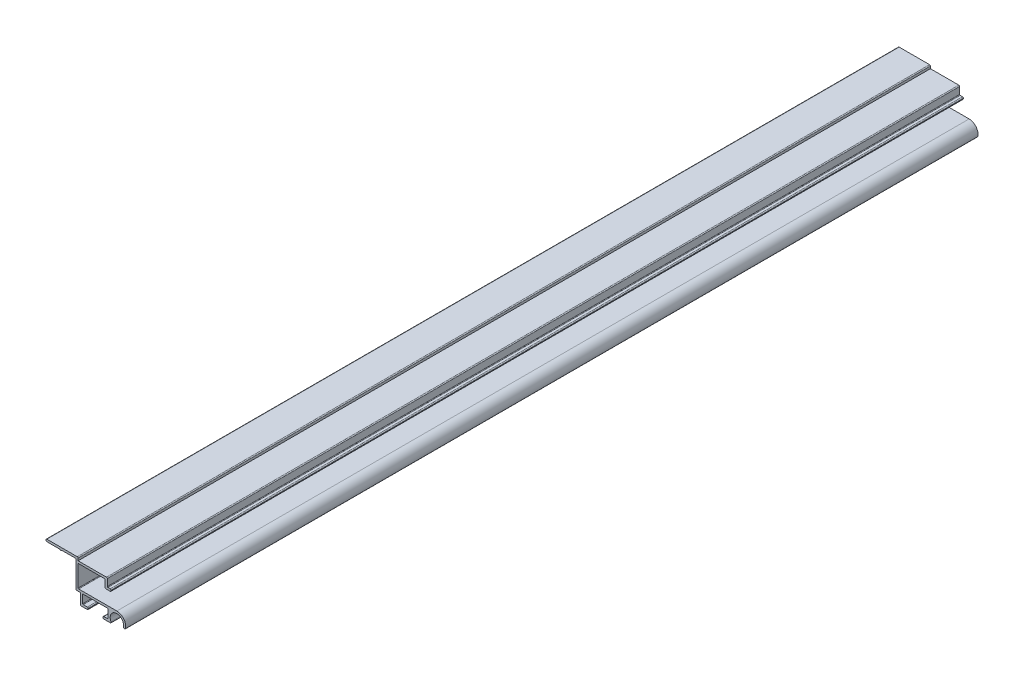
ISO-10303-21;
HEADER;
FILE_DESCRIPTION(('STEP AP214'),'2;1');
FILE_NAME('part.step','',(''),(''),'','','');
FILE_SCHEMA(('AUTOMOTIVE_DESIGN { 1 0 10303 214 1 1 1 1 }'));
ENDSEC;
DATA;
#1=APPLICATION_CONTEXT('core data for automotive mechanical design processes');
#2=APPLICATION_PROTOCOL_DEFINITION('international standard','automotive_design',2000,#1);
#3=PRODUCT_CONTEXT('',#1,'mechanical');
#4=PRODUCT('Part','Part','',(#3));
#5=PRODUCT_RELATED_PRODUCT_CATEGORY('part','',(#4));
#6=PRODUCT_DEFINITION_FORMATION('','',#4);
#7=PRODUCT_DEFINITION_CONTEXT('part definition',#1,'design');
#8=PRODUCT_DEFINITION('design','',#6,#7);
#9=PRODUCT_DEFINITION_SHAPE('','',#8);
#10=(LENGTH_UNIT() NAMED_UNIT(*) SI_UNIT(.MILLI.,.METRE.));
#11=(NAMED_UNIT(*) PLANE_ANGLE_UNIT() SI_UNIT($,.RADIAN.));
#12=(NAMED_UNIT(*) SI_UNIT($,.STERADIAN.) SOLID_ANGLE_UNIT());
#13=UNCERTAINTY_MEASURE_WITH_UNIT(LENGTH_MEASURE(1.E-05),#10,'distance_accuracy_value','');
#14=(GEOMETRIC_REPRESENTATION_CONTEXT(3) GLOBAL_UNCERTAINTY_ASSIGNED_CONTEXT((#13)) GLOBAL_UNIT_ASSIGNED_CONTEXT((#10,
#11,#12)) REPRESENTATION_CONTEXT('',''));
#15=CARTESIAN_POINT('',(0.,0.,0.));
#16=DIRECTION('',(0.,0.,1.));
#17=DIRECTION('',(1.,0.,0.));
#18=AXIS2_PLACEMENT_3D('',#15,#16,#17);
#19=CARTESIAN_POINT('',(0.400000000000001,-11.9,385.));
#20=DIRECTION('',(0.,0.,-1.));
#21=DIRECTION('',(-1.,0.,0.));
#22=AXIS2_PLACEMENT_3D('',#19,#20,#21);
#23=CYLINDRICAL_SURFACE('',#22,0.399999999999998);
#24=CARTESIAN_POINT('',(0.400000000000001,-11.9,0.));
#25=DIRECTION('',(0.,0.,1.));
#26=DIRECTION('',(1.,0.,0.));
#27=AXIS2_PLACEMENT_3D('',#24,#25,#26);
#28=CIRCLE('',#27,0.399999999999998);
#29=CARTESIAN_POINT('',(0.,-11.9,0.));
#30=VERTEX_POINT('',#29);
#31=CARTESIAN_POINT('',(0.400000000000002,-12.3,0.));
#32=VERTEX_POINT('',#31);
#33=EDGE_CURVE('E416',#30,#32,#28,.T.);
#34=ORIENTED_EDGE('',*,*,#33,.T.);
#35=DIRECTION('',(0.,0.,-1.));
#36=VECTOR('',#35,1.);
#37=CARTESIAN_POINT('',(0.400000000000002,-12.3,385.));
#38=LINE('',#37,#36);
#39=CARTESIAN_POINT('',(0.400000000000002,-12.3,385.));
#40=VERTEX_POINT('',#39);
#41=EDGE_CURVE('E40',#40,#32,#38,.T.);
#42=ORIENTED_EDGE('',*,*,#41,.F.);
#43=CARTESIAN_POINT('',(0.400000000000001,-11.9,385.));
#44=DIRECTION('',(0.,0.,1.));
#45=DIRECTION('',(1.,0.,0.));
#46=AXIS2_PLACEMENT_3D('',#43,#44,#45);
#47=CIRCLE('',#46,0.399999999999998);
#48=CARTESIAN_POINT('',(0.,-11.9,385.));
#49=VERTEX_POINT('',#48);
#50=EDGE_CURVE('E687',#49,#40,#47,.T.);
#51=ORIENTED_EDGE('',*,*,#50,.F.);
#52=DIRECTION('',(0.,0.,-1.));
#53=VECTOR('',#52,1.);
#54=CARTESIAN_POINT('',(0.,-11.9,385.));
#55=LINE('',#54,#53);
#56=EDGE_CURVE('E11',#49,#30,#55,.T.);
#57=ORIENTED_EDGE('',*,*,#56,.T.);
#58=EDGE_LOOP('',(#34,#42,#51,#57));
#59=FACE_BOUND('',#58,.T.);
#60=ADVANCED_FACE('F32',(#59),#23,.T.);
#61=CARTESIAN_POINT('',(1.,-12.3,385.));
#62=DIRECTION('',(0.,1.,0.));
#63=DIRECTION('',(0.,0.,1.));
#64=AXIS2_PLACEMENT_3D('',#61,#62,#63);
#65=PLANE('',#64);
#66=DIRECTION('',(1.,0.,0.));
#67=VECTOR('',#66,1.);
#68=CARTESIAN_POINT('',(1.,-12.3,0.));
#69=LINE('',#68,#67);
#70=CARTESIAN_POINT('',(1.80731682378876,-12.3,0.));
#71=VERTEX_POINT('',#70);
#72=EDGE_CURVE('E419',#32,#71,#69,.T.);
#73=ORIENTED_EDGE('',*,*,#72,.T.);
#74=DIRECTION('',(0.,0.,-1.));
#75=VECTOR('',#74,1.);
#76=CARTESIAN_POINT('',(1.80731682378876,-12.3,385.));
#77=LINE('',#76,#75);
#78=CARTESIAN_POINT('',(1.80731682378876,-12.3,385.));
#79=VERTEX_POINT('',#78);
#80=EDGE_CURVE('E676',#79,#71,#77,.T.);
#81=ORIENTED_EDGE('',*,*,#80,.F.);
#82=DIRECTION('',(1.,0.,0.));
#83=VECTOR('',#82,1.);
#84=CARTESIAN_POINT('',(1.,-12.3,385.));
#85=LINE('',#84,#83);
#86=EDGE_CURVE('E684',#40,#79,#85,.T.);
#87=ORIENTED_EDGE('',*,*,#86,.F.);
#88=ORIENTED_EDGE('',*,*,#41,.T.);
#89=EDGE_LOOP('',(#73,#81,#87,#88));
#90=FACE_BOUND('',#89,.T.);
#91=ADVANCED_FACE('F682',(#90),#65,.F.);
#92=CARTESIAN_POINT('',(1.80731682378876,-12.55,385.));
#93=DIRECTION('',(0.,0.,-1.));
#94=DIRECTION('',(-1.,0.,0.));
#95=AXIS2_PLACEMENT_3D('',#92,#93,#94);
#96=CYLINDRICAL_SURFACE('',#95,0.25);
#97=CARTESIAN_POINT('',(1.80731682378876,-12.55,0.));
#98=DIRECTION('',(0.,0.,-1.));
#99=DIRECTION('',(1.,0.,0.));
#100=AXIS2_PLACEMENT_3D('',#97,#98,#99);
#101=CIRCLE('',#100,0.25);
#102=CARTESIAN_POINT('',(2.05731682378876,-12.55,0.));
#103=VERTEX_POINT('',#102);
#104=EDGE_CURVE('E421',#71,#103,#101,.T.);
#105=ORIENTED_EDGE('',*,*,#104,.T.);
#106=DIRECTION('',(0.,0.,-1.));
#107=VECTOR('',#106,1.);
#108=CARTESIAN_POINT('',(2.05731682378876,-12.55,385.));
#109=LINE('',#108,#107);
#110=CARTESIAN_POINT('',(2.05731682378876,-12.55,385.));
#111=VERTEX_POINT('',#110);
#112=EDGE_CURVE('E673',#111,#103,#109,.T.);
#113=ORIENTED_EDGE('',*,*,#112,.F.);
#114=CARTESIAN_POINT('',(1.80731682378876,-12.55,385.));
#115=DIRECTION('',(0.,0.,-1.));
#116=DIRECTION('',(1.,0.,0.));
#117=AXIS2_PLACEMENT_3D('',#114,#115,#116);
#118=CIRCLE('',#117,0.25);
#119=EDGE_CURVE('E706',#79,#111,#118,.T.);
#120=ORIENTED_EDGE('',*,*,#119,.F.);
#121=ORIENTED_EDGE('',*,*,#80,.T.);
#122=EDGE_LOOP('',(#105,#113,#120,#121));
#123=FACE_BOUND('',#122,.T.);
#124=ADVANCED_FACE('F697',(#123),#96,.F.);
#125=CARTESIAN_POINT('',(2.05731682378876,-12.55,385.));
#126=DIRECTION('',(1.,0.,0.));
#127=DIRECTION('',(0.,1.,0.));
#128=AXIS2_PLACEMENT_3D('',#125,#126,#127);
#129=PLANE('',#128);
#130=DIRECTION('',(0.,-1.,0.));
#131=VECTOR('',#130,1.);
#132=CARTESIAN_POINT('',(2.05731682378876,-12.55,0.));
#133=LINE('',#132,#131);
#134=CARTESIAN_POINT('',(2.05731682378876,-17.,0.));
#135=VERTEX_POINT('',#134);
#136=EDGE_CURVE('E423',#103,#135,#133,.T.);
#137=ORIENTED_EDGE('',*,*,#136,.T.);
#138=DIRECTION('',(0.,0.,-1.));
#139=VECTOR('',#138,1.);
#140=CARTESIAN_POINT('',(2.05731682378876,-17.,385.));
#141=LINE('',#140,#139);
#142=CARTESIAN_POINT('',(2.05731682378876,-17.,385.));
#143=VERTEX_POINT('',#142);
#144=EDGE_CURVE('E670',#143,#135,#141,.T.);
#145=ORIENTED_EDGE('',*,*,#144,.F.);
#146=DIRECTION('',(0.,-1.,0.));
#147=VECTOR('',#146,1.);
#148=CARTESIAN_POINT('',(2.05731682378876,-12.55,385.));
#149=LINE('',#148,#147);
#150=EDGE_CURVE('E703',#111,#143,#149,.T.);
#151=ORIENTED_EDGE('',*,*,#150,.F.);
#152=ORIENTED_EDGE('',*,*,#112,.T.);
#153=EDGE_LOOP('',(#137,#145,#151,#152));
#154=FACE_BOUND('',#153,.T.);
#155=ADVANCED_FACE('F701',(#154),#129,.F.);
#156=CARTESIAN_POINT('',(2.45731682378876,-17.,385.));
#157=DIRECTION('',(0.,0.,-1.));
#158=DIRECTION('',(-1.,0.,0.));
#159=AXIS2_PLACEMENT_3D('',#156,#157,#158);
#160=CYLINDRICAL_SURFACE('',#159,0.400000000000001);
#161=CARTESIAN_POINT('',(2.45731682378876,-17.,0.));
#162=DIRECTION('',(0.,0.,1.));
#163=DIRECTION('',(1.,0.,0.));
#164=AXIS2_PLACEMENT_3D('',#161,#162,#163);
#165=CIRCLE('',#164,0.400000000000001);
#166=CARTESIAN_POINT('',(2.45731682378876,-17.4,0.));
#167=VERTEX_POINT('',#166);
#168=EDGE_CURVE('E425',#135,#167,#165,.T.);
#169=ORIENTED_EDGE('',*,*,#168,.T.);
#170=DIRECTION('',(0.,0.,-1.));
#171=VECTOR('',#170,1.);
#172=CARTESIAN_POINT('',(2.45731682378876,-17.4,385.));
#173=LINE('',#172,#171);
#174=CARTESIAN_POINT('',(2.45731682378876,-17.4,385.));
#175=VERTEX_POINT('',#174);
#176=EDGE_CURVE('E667',#175,#167,#173,.T.);
#177=ORIENTED_EDGE('',*,*,#176,.F.);
#178=CARTESIAN_POINT('',(2.45731682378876,-17.,385.));
#179=DIRECTION('',(0.,0.,1.));
#180=DIRECTION('',(1.,0.,0.));
#181=AXIS2_PLACEMENT_3D('',#178,#179,#180);
#182=CIRCLE('',#181,0.400000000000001);
#183=EDGE_CURVE('E705',#143,#175,#182,.T.);
#184=ORIENTED_EDGE('',*,*,#183,.F.);
#185=ORIENTED_EDGE('',*,*,#144,.T.);
#186=EDGE_LOOP('',(#169,#177,#184,#185));
#187=FACE_BOUND('',#186,.T.);
#188=ADVANCED_FACE('F1038',(#187),#160,.T.);
#189=CARTESIAN_POINT('',(2.45731682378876,-17.4,385.));
#190=DIRECTION('',(0.,1.,0.));
#191=DIRECTION('',(0.,0.,1.));
#192=AXIS2_PLACEMENT_3D('',#189,#190,#191);
#193=PLANE('',#192);
#194=DIRECTION('',(1.,0.,0.));
#195=VECTOR('',#194,1.);
#196=CARTESIAN_POINT('',(2.45731682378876,-17.4,0.));
#197=LINE('',#196,#195);
#198=CARTESIAN_POINT('',(5.15731682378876,-17.4,0.));
#199=VERTEX_POINT('',#198);
#200=EDGE_CURVE('E427',#167,#199,#197,.T.);
#201=ORIENTED_EDGE('',*,*,#200,.T.);
#202=DIRECTION('',(0.,0.,-1.));
#203=VECTOR('',#202,1.);
#204=CARTESIAN_POINT('',(5.15731682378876,-17.4,385.));
#205=LINE('',#204,#203);
#206=CARTESIAN_POINT('',(5.15731682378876,-17.4,385.));
#207=VERTEX_POINT('',#206);
#208=EDGE_CURVE('E664',#207,#199,#205,.T.);
#209=ORIENTED_EDGE('',*,*,#208,.F.);
#210=DIRECTION('',(1.,0.,0.));
#211=VECTOR('',#210,1.);
#212=CARTESIAN_POINT('',(2.45731682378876,-17.4,385.));
#213=LINE('',#212,#211);
#214=EDGE_CURVE('E708',#175,#207,#213,.T.);
#215=ORIENTED_EDGE('',*,*,#214,.F.);
#216=ORIENTED_EDGE('',*,*,#176,.T.);
#217=EDGE_LOOP('',(#201,#209,#215,#216));
#218=FACE_BOUND('',#217,.T.);
#219=ADVANCED_FACE('F1035',(#218),#193,.F.);
#220=CARTESIAN_POINT('',(5.15731682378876,-17.,385.));
#221=DIRECTION('',(0.,0.,-1.));
#222=DIRECTION('',(-1.,0.,0.));
#223=AXIS2_PLACEMENT_3D('',#220,#221,#222);
#224=CYLINDRICAL_SURFACE('',#223,0.400000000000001);
#225=CARTESIAN_POINT('',(5.15731682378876,-17.,0.));
#226=DIRECTION('',(0.,0.,1.));
#227=DIRECTION('',(1.,0.,0.));
#228=AXIS2_PLACEMENT_3D('',#225,#226,#227);
#229=CIRCLE('',#228,0.400000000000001);
#230=CARTESIAN_POINT('',(5.55731682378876,-17.,0.));
#231=VERTEX_POINT('',#230);
#232=EDGE_CURVE('E429',#199,#231,#229,.T.);
#233=ORIENTED_EDGE('',*,*,#232,.T.);
#234=DIRECTION('',(0.,0.,-1.));
#235=VECTOR('',#234,1.);
#236=CARTESIAN_POINT('',(5.55731682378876,-17.,385.));
#237=LINE('',#236,#235);
#238=CARTESIAN_POINT('',(5.55731682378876,-17.,385.));
#239=VERTEX_POINT('',#238);
#240=EDGE_CURVE('E661',#239,#231,#237,.T.);
#241=ORIENTED_EDGE('',*,*,#240,.F.);
#242=CARTESIAN_POINT('',(5.15731682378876,-17.,385.));
#243=DIRECTION('',(0.,0.,1.));
#244=DIRECTION('',(1.,0.,0.));
#245=AXIS2_PLACEMENT_3D('',#242,#243,#244);
#246=CIRCLE('',#245,0.400000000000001);
#247=EDGE_CURVE('E714',#207,#239,#246,.T.);
#248=ORIENTED_EDGE('',*,*,#247,.F.);
#249=ORIENTED_EDGE('',*,*,#208,.T.);
#250=EDGE_LOOP('',(#233,#241,#248,#249));
#251=FACE_BOUND('',#250,.T.);
#252=ADVANCED_FACE('F1031',(#251),#224,.T.);
#253=CARTESIAN_POINT('',(5.55731682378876,-16.8,385.));
#254=DIRECTION('',(-1.,0.,0.));
#255=DIRECTION('',(0.,0.,1.));
#256=AXIS2_PLACEMENT_3D('',#253,#254,#255);
#257=PLANE('',#256);
#258=DIRECTION('',(0.,1.,0.));
#259=VECTOR('',#258,1.);
#260=CARTESIAN_POINT('',(5.55731682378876,-16.8,0.));
#261=LINE('',#260,#259);
#262=CARTESIAN_POINT('',(5.55731682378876,-16.8,0.));
#263=VERTEX_POINT('',#262);
#264=EDGE_CURVE('E431',#231,#263,#261,.T.);
#265=ORIENTED_EDGE('',*,*,#264,.T.);
#266=DIRECTION('',(0.,0.,-1.));
#267=VECTOR('',#266,1.);
#268=CARTESIAN_POINT('',(5.55731682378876,-16.8,385.));
#269=LINE('',#268,#267);
#270=CARTESIAN_POINT('',(5.55731682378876,-16.8,385.));
#271=VERTEX_POINT('',#270);
#272=EDGE_CURVE('E658',#271,#263,#269,.T.);
#273=ORIENTED_EDGE('',*,*,#272,.F.);
#274=DIRECTION('',(0.,1.,0.));
#275=VECTOR('',#274,1.);
#276=CARTESIAN_POINT('',(5.55731682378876,-16.8,385.));
#277=LINE('',#276,#275);
#278=EDGE_CURVE('E716',#239,#271,#277,.T.);
#279=ORIENTED_EDGE('',*,*,#278,.F.);
#280=ORIENTED_EDGE('',*,*,#240,.T.);
#281=EDGE_LOOP('',(#265,#273,#279,#280));
#282=FACE_BOUND('',#281,.T.);
#283=ADVANCED_FACE('F1026',(#282),#257,.F.);
#284=CARTESIAN_POINT('',(5.15731682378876,-16.8,385.));
#285=DIRECTION('',(0.,0.,-1.));
#286=DIRECTION('',(-1.,0.,0.));
#287=AXIS2_PLACEMENT_3D('',#284,#285,#286);
#288=CYLINDRICAL_SURFACE('',#287,0.400000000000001);
#289=CARTESIAN_POINT('',(5.15731682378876,-16.8,0.));
#290=DIRECTION('',(0.,0.,1.));
#291=DIRECTION('',(-1.,0.,0.));
#292=AXIS2_PLACEMENT_3D('',#289,#290,#291);
#293=CIRCLE('',#292,0.400000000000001);
#294=CARTESIAN_POINT('',(5.15731682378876,-16.4,0.));
#295=VERTEX_POINT('',#294);
#296=EDGE_CURVE('E433',#263,#295,#293,.T.);
#297=ORIENTED_EDGE('',*,*,#296,.T.);
#298=DIRECTION('',(0.,0.,-1.));
#299=VECTOR('',#298,1.);
#300=CARTESIAN_POINT('',(5.15731682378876,-16.4,385.));
#301=LINE('',#300,#299);
#302=CARTESIAN_POINT('',(5.15731682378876,-16.4,385.));
#303=VERTEX_POINT('',#302);
#304=EDGE_CURVE('E655',#303,#295,#301,.T.);
#305=ORIENTED_EDGE('',*,*,#304,.F.);
#306=CARTESIAN_POINT('',(5.15731682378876,-16.8,385.));
#307=DIRECTION('',(0.,0.,1.));
#308=DIRECTION('',(-1.,0.,0.));
#309=AXIS2_PLACEMENT_3D('',#306,#307,#308);
#310=CIRCLE('',#309,0.400000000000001);
#311=EDGE_CURVE('E718',#271,#303,#310,.T.);
#312=ORIENTED_EDGE('',*,*,#311,.F.);
#313=ORIENTED_EDGE('',*,*,#272,.T.);
#314=EDGE_LOOP('',(#297,#305,#312,#313));
#315=FACE_BOUND('',#314,.T.);
#316=ADVANCED_FACE('F1020',(#315),#288,.T.);
#317=CARTESIAN_POINT('',(3.30731682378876,-16.4,385.));
#318=DIRECTION('',(0.,-1.,0.));
#319=DIRECTION('',(0.,0.,-1.));
#320=AXIS2_PLACEMENT_3D('',#317,#318,#319);
#321=PLANE('',#320);
#322=DIRECTION('',(-1.,0.,0.));
#323=VECTOR('',#322,1.);
#324=CARTESIAN_POINT('',(3.30731682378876,-16.4,0.));
#325=LINE('',#324,#323);
#326=CARTESIAN_POINT('',(3.30731682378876,-16.4,0.));
#327=VERTEX_POINT('',#326);
#328=EDGE_CURVE('E435',#295,#327,#325,.T.);
#329=ORIENTED_EDGE('',*,*,#328,.T.);
#330=DIRECTION('',(0.,0.,-1.));
#331=VECTOR('',#330,1.);
#332=CARTESIAN_POINT('',(3.30731682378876,-16.4,385.));
#333=LINE('',#332,#331);
#334=CARTESIAN_POINT('',(3.30731682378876,-16.4,385.));
#335=VERTEX_POINT('',#334);
#336=EDGE_CURVE('E652',#335,#327,#333,.T.);
#337=ORIENTED_EDGE('',*,*,#336,.F.);
#338=DIRECTION('',(-1.,0.,0.));
#339=VECTOR('',#338,1.);
#340=CARTESIAN_POINT('',(3.30731682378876,-16.4,385.));
#341=LINE('',#340,#339);
#342=EDGE_CURVE('E720',#303,#335,#341,.T.);
#343=ORIENTED_EDGE('',*,*,#342,.F.);
#344=ORIENTED_EDGE('',*,*,#304,.T.);
#345=EDGE_LOOP('',(#329,#337,#343,#344));
#346=FACE_BOUND('',#345,.T.);
#347=ADVANCED_FACE('F1016',(#346),#321,.F.);
#348=CARTESIAN_POINT('',(3.30731682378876,-16.15,385.));
#349=DIRECTION('',(0.,0.,-1.));
#350=DIRECTION('',(-1.,0.,0.));
#351=AXIS2_PLACEMENT_3D('',#348,#349,#350);
#352=CYLINDRICAL_SURFACE('',#351,0.25);
#353=CARTESIAN_POINT('',(3.30731682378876,-16.15,0.));
#354=DIRECTION('',(0.,0.,-1.));
#355=DIRECTION('',(1.,0.,0.));
#356=AXIS2_PLACEMENT_3D('',#353,#354,#355);
#357=CIRCLE('',#356,0.25);
#358=CARTESIAN_POINT('',(3.05731682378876,-16.15,0.));
#359=VERTEX_POINT('',#358);
#360=EDGE_CURVE('E437',#327,#359,#357,.T.);
#361=ORIENTED_EDGE('',*,*,#360,.T.);
#362=DIRECTION('',(0.,0.,-1.));
#363=VECTOR('',#362,1.);
#364=CARTESIAN_POINT('',(3.05731682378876,-16.15,385.));
#365=LINE('',#364,#363);
#366=CARTESIAN_POINT('',(3.05731682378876,-16.15,385.));
#367=VERTEX_POINT('',#366);
#368=EDGE_CURVE('E649',#367,#359,#365,.T.);
#369=ORIENTED_EDGE('',*,*,#368,.F.);
#370=CARTESIAN_POINT('',(3.30731682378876,-16.15,385.));
#371=DIRECTION('',(0.,0.,-1.));
#372=DIRECTION('',(1.,0.,0.));
#373=AXIS2_PLACEMENT_3D('',#370,#371,#372);
#374=CIRCLE('',#373,0.25);
#375=EDGE_CURVE('E722',#335,#367,#374,.T.);
#376=ORIENTED_EDGE('',*,*,#375,.F.);
#377=ORIENTED_EDGE('',*,*,#336,.T.);
#378=EDGE_LOOP('',(#361,#369,#376,#377));
#379=FACE_BOUND('',#378,.T.);
#380=ADVANCED_FACE('F1011',(#379),#352,.F.);
#381=CARTESIAN_POINT('',(3.05731682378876,-12.55,385.));
#382=DIRECTION('',(-1.,0.,0.));
#383=DIRECTION('',(0.,-1.,0.));
#384=AXIS2_PLACEMENT_3D('',#381,#382,#383);
#385=PLANE('',#384);
#386=DIRECTION('',(0.,1.,0.));
#387=VECTOR('',#386,1.);
#388=CARTESIAN_POINT('',(3.05731682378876,-12.55,0.));
#389=LINE('',#388,#387);
#390=CARTESIAN_POINT('',(3.05731682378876,-12.55,0.));
#391=VERTEX_POINT('',#390);
#392=EDGE_CURVE('E439',#359,#391,#389,.T.);
#393=ORIENTED_EDGE('',*,*,#392,.T.);
#394=DIRECTION('',(0.,0.,-1.));
#395=VECTOR('',#394,1.);
#396=CARTESIAN_POINT('',(3.05731682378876,-12.55,385.));
#397=LINE('',#396,#395);
#398=CARTESIAN_POINT('',(3.05731682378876,-12.55,385.));
#399=VERTEX_POINT('',#398);
#400=EDGE_CURVE('E646',#399,#391,#397,.T.);
#401=ORIENTED_EDGE('',*,*,#400,.F.);
#402=DIRECTION('',(0.,1.,0.));
#403=VECTOR('',#402,1.);
#404=CARTESIAN_POINT('',(3.05731682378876,-12.55,385.));
#405=LINE('',#404,#403);
#406=EDGE_CURVE('E724',#367,#399,#405,.T.);
#407=ORIENTED_EDGE('',*,*,#406,.F.);
#408=ORIENTED_EDGE('',*,*,#368,.T.);
#409=EDGE_LOOP('',(#393,#401,#407,#408));
#410=FACE_BOUND('',#409,.T.);
#411=ADVANCED_FACE('F1005',(#410),#385,.F.);
#412=CARTESIAN_POINT('',(3.30731682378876,-12.55,385.));
#413=DIRECTION('',(0.,0.,-1.));
#414=DIRECTION('',(-1.,0.,0.));
#415=AXIS2_PLACEMENT_3D('',#412,#413,#414);
#416=CYLINDRICAL_SURFACE('',#415,0.25);
#417=CARTESIAN_POINT('',(3.30731682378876,-12.55,0.));
#418=DIRECTION('',(0.,0.,-1.));
#419=DIRECTION('',(-1.,0.,0.));
#420=AXIS2_PLACEMENT_3D('',#417,#418,#419);
#421=CIRCLE('',#420,0.25);
#422=CARTESIAN_POINT('',(3.30731682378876,-12.3,0.));
#423=VERTEX_POINT('',#422);
#424=EDGE_CURVE('E441',#391,#423,#421,.T.);
#425=ORIENTED_EDGE('',*,*,#424,.T.);
#426=DIRECTION('',(0.,0.,-1.));
#427=VECTOR('',#426,1.);
#428=CARTESIAN_POINT('',(3.30731682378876,-12.3,385.));
#429=LINE('',#428,#427);
#430=CARTESIAN_POINT('',(3.30731682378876,-12.3,385.));
#431=VERTEX_POINT('',#430);
#432=EDGE_CURVE('E643',#431,#423,#429,.T.);
#433=ORIENTED_EDGE('',*,*,#432,.F.);
#434=CARTESIAN_POINT('',(3.30731682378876,-12.55,385.));
#435=DIRECTION('',(0.,0.,-1.));
#436=DIRECTION('',(-1.,0.,0.));
#437=AXIS2_PLACEMENT_3D('',#434,#435,#436);
#438=CIRCLE('',#437,0.25);
#439=EDGE_CURVE('E726',#399,#431,#438,.T.);
#440=ORIENTED_EDGE('',*,*,#439,.F.);
#441=ORIENTED_EDGE('',*,*,#400,.T.);
#442=EDGE_LOOP('',(#425,#433,#440,#441));
#443=FACE_BOUND('',#442,.T.);
#444=ADVANCED_FACE('F1001',(#443),#416,.F.);
#445=CARTESIAN_POINT('',(3.30731682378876,-12.3,385.));
#446=DIRECTION('',(0.,1.,0.));
#447=DIRECTION('',(-1.,0.,0.));
#448=AXIS2_PLACEMENT_3D('',#445,#446,#447);
#449=PLANE('',#448);
#450=DIRECTION('',(1.,0.,0.));
#451=VECTOR('',#450,1.);
#452=CARTESIAN_POINT('',(3.30731682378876,-12.3,0.));
#453=LINE('',#452,#451);
#454=CARTESIAN_POINT('',(14.25,-12.3,0.));
#455=VERTEX_POINT('',#454);
#456=EDGE_CURVE('E443',#423,#455,#453,.T.);
#457=ORIENTED_EDGE('',*,*,#456,.T.);
#458=DIRECTION('',(0.,0.,-1.));
#459=VECTOR('',#458,1.);
#460=CARTESIAN_POINT('',(14.25,-12.3,385.));
#461=LINE('',#460,#459);
#462=CARTESIAN_POINT('',(14.25,-12.3,385.));
#463=VERTEX_POINT('',#462);
#464=EDGE_CURVE('E640',#463,#455,#461,.T.);
#465=ORIENTED_EDGE('',*,*,#464,.F.);
#466=DIRECTION('',(1.,0.,0.));
#467=VECTOR('',#466,1.);
#468=CARTESIAN_POINT('',(3.30731682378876,-12.3,385.));
#469=LINE('',#468,#467);
#470=EDGE_CURVE('E728',#431,#463,#469,.T.);
#471=ORIENTED_EDGE('',*,*,#470,.F.);
#472=ORIENTED_EDGE('',*,*,#432,.T.);
#473=EDGE_LOOP('',(#457,#465,#471,#472));
#474=FACE_BOUND('',#473,.T.);
#475=ADVANCED_FACE('F996',(#474),#449,.F.);
#476=CARTESIAN_POINT('',(14.25,-12.55,385.));
#477=DIRECTION('',(0.,0.,-1.));
#478=DIRECTION('',(-1.,0.,0.));
#479=AXIS2_PLACEMENT_3D('',#476,#477,#478);
#480=CYLINDRICAL_SURFACE('',#479,0.249999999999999);
#481=CARTESIAN_POINT('',(14.25,-12.55,0.));
#482=DIRECTION('',(0.,0.,-1.));
#483=DIRECTION('',(1.,0.,0.));
#484=AXIS2_PLACEMENT_3D('',#481,#482,#483);
#485=CIRCLE('',#484,0.249999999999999);
#486=CARTESIAN_POINT('',(14.5,-12.55,0.));
#487=VERTEX_POINT('',#486);
#488=EDGE_CURVE('E445',#455,#487,#485,.T.);
#489=ORIENTED_EDGE('',*,*,#488,.T.);
#490=DIRECTION('',(0.,0.,-1.));
#491=VECTOR('',#490,1.);
#492=CARTESIAN_POINT('',(14.5,-12.55,385.));
#493=LINE('',#492,#491);
#494=CARTESIAN_POINT('',(14.5,-12.55,385.));
#495=VERTEX_POINT('',#494);
#496=EDGE_CURVE('E637',#495,#487,#493,.T.);
#497=ORIENTED_EDGE('',*,*,#496,.F.);
#498=CARTESIAN_POINT('',(14.25,-12.55,385.));
#499=DIRECTION('',(0.,0.,-1.));
#500=DIRECTION('',(1.,0.,0.));
#501=AXIS2_PLACEMENT_3D('',#498,#499,#500);
#502=CIRCLE('',#501,0.249999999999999);
#503=EDGE_CURVE('E730',#463,#495,#502,.T.);
#504=ORIENTED_EDGE('',*,*,#503,.F.);
#505=ORIENTED_EDGE('',*,*,#464,.T.);
#506=EDGE_LOOP('',(#489,#497,#504,#505));
#507=FACE_BOUND('',#506,.T.);
#508=ADVANCED_FACE('F990',(#507),#480,.F.);
#509=CARTESIAN_POINT('',(14.5,-12.55,385.));
#510=DIRECTION('',(1.,0.,0.));
#511=DIRECTION('',(0.,0.,-1.));
#512=AXIS2_PLACEMENT_3D('',#509,#510,#511);
#513=PLANE('',#512);
#514=DIRECTION('',(0.,-1.,0.));
#515=VECTOR('',#514,1.);
#516=CARTESIAN_POINT('',(14.5,-12.55,0.));
#517=LINE('',#516,#515);
#518=CARTESIAN_POINT('',(14.5,-16.15,0.));
#519=VERTEX_POINT('',#518);
#520=EDGE_CURVE('E447',#487,#519,#517,.T.);
#521=ORIENTED_EDGE('',*,*,#520,.T.);
#522=DIRECTION('',(0.,0.,-1.));
#523=VECTOR('',#522,1.);
#524=CARTESIAN_POINT('',(14.5,-16.15,385.));
#525=LINE('',#524,#523);
#526=CARTESIAN_POINT('',(14.5,-16.15,385.));
#527=VERTEX_POINT('',#526);
#528=EDGE_CURVE('E634',#527,#519,#525,.T.);
#529=ORIENTED_EDGE('',*,*,#528,.F.);
#530=DIRECTION('',(0.,-1.,0.));
#531=VECTOR('',#530,1.);
#532=CARTESIAN_POINT('',(14.5,-12.55,385.));
#533=LINE('',#532,#531);
#534=EDGE_CURVE('E732',#495,#527,#533,.T.);
#535=ORIENTED_EDGE('',*,*,#534,.F.);
#536=ORIENTED_EDGE('',*,*,#496,.T.);
#537=EDGE_LOOP('',(#521,#529,#535,#536));
#538=FACE_BOUND('',#537,.T.);
#539=ADVANCED_FACE('F986',(#538),#513,.F.);
#540=CARTESIAN_POINT('',(14.25,-16.15,385.));
#541=DIRECTION('',(0.,0.,-1.));
#542=DIRECTION('',(-1.,0.,0.));
#543=AXIS2_PLACEMENT_3D('',#540,#541,#542);
#544=CYLINDRICAL_SURFACE('',#543,0.25);
#545=CARTESIAN_POINT('',(14.25,-16.15,0.));
#546=DIRECTION('',(0.,0.,-1.));
#547=DIRECTION('',(-1.,0.,0.));
#548=AXIS2_PLACEMENT_3D('',#545,#546,#547);
#549=CIRCLE('',#548,0.25);
#550=CARTESIAN_POINT('',(14.25,-16.4,0.));
#551=VERTEX_POINT('',#550);
#552=EDGE_CURVE('E449',#519,#551,#549,.T.);
#553=ORIENTED_EDGE('',*,*,#552,.T.);
#554=DIRECTION('',(0.,0.,-1.));
#555=VECTOR('',#554,1.);
#556=CARTESIAN_POINT('',(14.25,-16.4,385.));
#557=LINE('',#556,#555);
#558=CARTESIAN_POINT('',(14.25,-16.4,385.));
#559=VERTEX_POINT('',#558);
#560=EDGE_CURVE('E631',#559,#551,#557,.T.);
#561=ORIENTED_EDGE('',*,*,#560,.F.);
#562=CARTESIAN_POINT('',(14.25,-16.15,385.));
#563=DIRECTION('',(0.,0.,-1.));
#564=DIRECTION('',(-1.,0.,0.));
#565=AXIS2_PLACEMENT_3D('',#562,#563,#564);
#566=CIRCLE('',#565,0.25);
#567=EDGE_CURVE('E734',#527,#559,#566,.T.);
#568=ORIENTED_EDGE('',*,*,#567,.F.);
#569=ORIENTED_EDGE('',*,*,#528,.T.);
#570=EDGE_LOOP('',(#553,#561,#568,#569));
#571=FACE_BOUND('',#570,.T.);
#572=ADVANCED_FACE('F981',(#571),#544,.F.);
#573=CARTESIAN_POINT('',(12.6573168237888,-16.4,385.));
#574=DIRECTION('',(0.,-1.,0.));
#575=DIRECTION('',(0.,0.,-1.));
#576=AXIS2_PLACEMENT_3D('',#573,#574,#575);
#577=PLANE('',#576);
#578=DIRECTION('',(-1.,0.,0.));
#579=VECTOR('',#578,1.);
#580=CARTESIAN_POINT('',(12.6573168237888,-16.4,0.));
#581=LINE('',#580,#579);
#582=CARTESIAN_POINT('',(12.6573168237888,-16.4,0.));
#583=VERTEX_POINT('',#582);
#584=EDGE_CURVE('E451',#551,#583,#581,.T.);
#585=ORIENTED_EDGE('',*,*,#584,.T.);
#586=DIRECTION('',(0.,0.,-1.));
#587=VECTOR('',#586,1.);
#588=CARTESIAN_POINT('',(12.6573168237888,-16.4,385.));
#589=LINE('',#588,#587);
#590=CARTESIAN_POINT('',(12.6573168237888,-16.4,385.));
#591=VERTEX_POINT('',#590);
#592=EDGE_CURVE('E628',#591,#583,#589,.T.);
#593=ORIENTED_EDGE('',*,*,#592,.F.);
#594=DIRECTION('',(-1.,0.,0.));
#595=VECTOR('',#594,1.);
#596=CARTESIAN_POINT('',(12.6573168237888,-16.4,385.));
#597=LINE('',#596,#595);
#598=EDGE_CURVE('E736',#559,#591,#597,.T.);
#599=ORIENTED_EDGE('',*,*,#598,.F.);
#600=ORIENTED_EDGE('',*,*,#560,.T.);
#601=EDGE_LOOP('',(#585,#593,#599,#600));
#602=FACE_BOUND('',#601,.T.);
#603=ADVANCED_FACE('F975',(#602),#577,.F.);
#604=CARTESIAN_POINT('',(12.6573168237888,-16.8,385.));
#605=DIRECTION('',(0.,0.,-1.));
#606=DIRECTION('',(-1.,0.,0.));
#607=AXIS2_PLACEMENT_3D('',#604,#605,#606);
#608=CYLINDRICAL_SURFACE('',#607,0.4);
#609=CARTESIAN_POINT('',(12.6573168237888,-16.8,0.));
#610=DIRECTION('',(0.,0.,1.));
#611=DIRECTION('',(-1.,0.,0.));
#612=AXIS2_PLACEMENT_3D('',#609,#610,#611);
#613=CIRCLE('',#612,0.4);
#614=CARTESIAN_POINT('',(12.2573168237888,-16.8,0.));
#615=VERTEX_POINT('',#614);
#616=EDGE_CURVE('E453',#583,#615,#613,.T.);
#617=ORIENTED_EDGE('',*,*,#616,.T.);
#618=DIRECTION('',(0.,0.,-1.));
#619=VECTOR('',#618,1.);
#620=CARTESIAN_POINT('',(12.2573168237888,-16.8,385.));
#621=LINE('',#620,#619);
#622=CARTESIAN_POINT('',(12.2573168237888,-16.8,385.));
#623=VERTEX_POINT('',#622);
#624=EDGE_CURVE('E625',#623,#615,#621,.T.);
#625=ORIENTED_EDGE('',*,*,#624,.F.);
#626=CARTESIAN_POINT('',(12.6573168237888,-16.8,385.));
#627=DIRECTION('',(0.,0.,1.));
#628=DIRECTION('',(-1.,0.,0.));
#629=AXIS2_PLACEMENT_3D('',#626,#627,#628);
#630=CIRCLE('',#629,0.4);
#631=EDGE_CURVE('E738',#591,#623,#630,.T.);
#632=ORIENTED_EDGE('',*,*,#631,.F.);
#633=ORIENTED_EDGE('',*,*,#592,.T.);
#634=EDGE_LOOP('',(#617,#625,#632,#633));
#635=FACE_BOUND('',#634,.T.);
#636=ADVANCED_FACE('F971',(#635),#608,.T.);
#637=CARTESIAN_POINT('',(12.2573168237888,-17.,385.));
#638=DIRECTION('',(1.,0.,0.));
#639=DIRECTION('',(0.,0.,-1.));
#640=AXIS2_PLACEMENT_3D('',#637,#638,#639);
#641=PLANE('',#640);
#642=DIRECTION('',(0.,-1.,0.));
#643=VECTOR('',#642,1.);
#644=CARTESIAN_POINT('',(12.2573168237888,-17.,0.));
#645=LINE('',#644,#643);
#646=CARTESIAN_POINT('',(12.2573168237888,-17.,0.));
#647=VERTEX_POINT('',#646);
#648=EDGE_CURVE('E455',#615,#647,#645,.T.);
#649=ORIENTED_EDGE('',*,*,#648,.T.);
#650=DIRECTION('',(0.,0.,-1.));
#651=VECTOR('',#650,1.);
#652=CARTESIAN_POINT('',(12.2573168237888,-17.,385.));
#653=LINE('',#652,#651);
#654=CARTESIAN_POINT('',(12.2573168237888,-17.,385.));
#655=VERTEX_POINT('',#654);
#656=EDGE_CURVE('E622',#655,#647,#653,.T.);
#657=ORIENTED_EDGE('',*,*,#656,.F.);
#658=DIRECTION('',(0.,-1.,0.));
#659=VECTOR('',#658,1.);
#660=CARTESIAN_POINT('',(12.2573168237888,-17.,385.));
#661=LINE('',#660,#659);
#662=EDGE_CURVE('E740',#623,#655,#661,.T.);
#663=ORIENTED_EDGE('',*,*,#662,.F.);
#664=ORIENTED_EDGE('',*,*,#624,.T.);
#665=EDGE_LOOP('',(#649,#657,#663,#664));
#666=FACE_BOUND('',#665,.T.);
#667=ADVANCED_FACE('F966',(#666),#641,.F.);
#668=CARTESIAN_POINT('',(12.6573168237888,-17.,385.));
#669=DIRECTION('',(0.,0.,-1.));
#670=DIRECTION('',(-1.,0.,0.));
#671=AXIS2_PLACEMENT_3D('',#668,#669,#670);
#672=CYLINDRICAL_SURFACE('',#671,0.4);
#673=CARTESIAN_POINT('',(12.6573168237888,-17.,0.));
#674=DIRECTION('',(0.,0.,1.));
#675=DIRECTION('',(-1.,0.,0.));
#676=AXIS2_PLACEMENT_3D('',#673,#674,#675);
#677=CIRCLE('',#676,0.4);
#678=CARTESIAN_POINT('',(12.6573168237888,-17.4,0.));
#679=VERTEX_POINT('',#678);
#680=EDGE_CURVE('E457',#647,#679,#677,.T.);
#681=ORIENTED_EDGE('',*,*,#680,.T.);
#682=DIRECTION('',(0.,0.,-1.));
#683=VECTOR('',#682,1.);
#684=CARTESIAN_POINT('',(12.6573168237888,-17.4,385.));
#685=LINE('',#684,#683);
#686=CARTESIAN_POINT('',(12.6573168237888,-17.4,385.));
#687=VERTEX_POINT('',#686);
#688=EDGE_CURVE('E619',#687,#679,#685,.T.);
#689=ORIENTED_EDGE('',*,*,#688,.F.);
#690=CARTESIAN_POINT('',(12.6573168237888,-17.,385.));
#691=DIRECTION('',(0.,0.,1.));
#692=DIRECTION('',(-1.,0.,0.));
#693=AXIS2_PLACEMENT_3D('',#690,#691,#692);
#694=CIRCLE('',#693,0.4);
#695=EDGE_CURVE('E742',#655,#687,#694,.T.);
#696=ORIENTED_EDGE('',*,*,#695,.F.);
#697=ORIENTED_EDGE('',*,*,#656,.T.);
#698=EDGE_LOOP('',(#681,#689,#696,#697));
#699=FACE_BOUND('',#698,.T.);
#700=ADVANCED_FACE('F960',(#699),#672,.T.);
#701=CARTESIAN_POINT('',(15.5553036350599,-17.4,385.));
#702=DIRECTION('',(0.,1.,0.));
#703=DIRECTION('',(0.,0.,1.));
#704=AXIS2_PLACEMENT_3D('',#701,#702,#703);
#705=PLANE('',#704);
#706=DIRECTION('',(1.,0.,0.));
#707=VECTOR('',#706,1.);
#708=CARTESIAN_POINT('',(15.5553036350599,-17.4,0.));
#709=LINE('',#708,#707);
#710=CARTESIAN_POINT('',(15.5553036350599,-17.4,0.));
#711=VERTEX_POINT('',#710);
#712=EDGE_CURVE('E459',#679,#711,#709,.T.);
#713=ORIENTED_EDGE('',*,*,#712,.T.);
#714=DIRECTION('',(0.,0.,-1.));
#715=VECTOR('',#714,1.);
#716=CARTESIAN_POINT('',(15.5553036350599,-17.4,385.));
#717=LINE('',#716,#715);
#718=CARTESIAN_POINT('',(15.5553036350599,-17.4,385.));
#719=VERTEX_POINT('',#718);
#720=EDGE_CURVE('E616',#719,#711,#717,.T.);
#721=ORIENTED_EDGE('',*,*,#720,.F.);
#722=DIRECTION('',(1.,0.,0.));
#723=VECTOR('',#722,1.);
#724=CARTESIAN_POINT('',(15.5553036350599,-17.4,385.));
#725=LINE('',#724,#723);
#726=EDGE_CURVE('E744',#687,#719,#725,.T.);
#727=ORIENTED_EDGE('',*,*,#726,.F.);
#728=ORIENTED_EDGE('',*,*,#688,.T.);
#729=EDGE_LOOP('',(#713,#721,#727,#728));
#730=FACE_BOUND('',#729,.T.);
#731=ADVANCED_FACE('F956',(#730),#705,.F.);
#732=CARTESIAN_POINT('',(15.5553036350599,-17.,385.));
#733=DIRECTION('',(0.,0.,-1.));
#734=DIRECTION('',(-1.,0.,0.));
#735=AXIS2_PLACEMENT_3D('',#732,#733,#734);
#736=CYLINDRICAL_SURFACE('',#735,0.400000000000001);
#737=CARTESIAN_POINT('',(15.5553036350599,-17.,0.));
#738=DIRECTION('',(0.,0.,1.));
#739=DIRECTION('',(-1.,0.,0.));
#740=AXIS2_PLACEMENT_3D('',#737,#738,#739);
#741=CIRCLE('',#740,0.400000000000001);
#742=CARTESIAN_POINT('',(15.9017199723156,-16.8000106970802,0.));
#743=VERTEX_POINT('',#742);
#744=EDGE_CURVE('E461',#711,#743,#741,.T.);
#745=ORIENTED_EDGE('',*,*,#744,.T.);
#746=DIRECTION('',(0.,0.,-1.));
#747=VECTOR('',#746,1.);
#748=CARTESIAN_POINT('',(15.9017199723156,-16.8000106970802,385.));
#749=LINE('',#748,#747);
#750=CARTESIAN_POINT('',(15.9017199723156,-16.8000106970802,385.));
#751=VERTEX_POINT('',#750);
#752=EDGE_CURVE('E613',#751,#743,#749,.T.);
#753=ORIENTED_EDGE('',*,*,#752,.F.);
#754=CARTESIAN_POINT('',(15.5553036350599,-17.,385.));
#755=DIRECTION('',(0.,0.,1.));
#756=DIRECTION('',(-1.,0.,0.));
#757=AXIS2_PLACEMENT_3D('',#754,#755,#756);
#758=CIRCLE('',#757,0.400000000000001);
#759=EDGE_CURVE('E746',#719,#751,#758,.T.);
#760=ORIENTED_EDGE('',*,*,#759,.F.);
#761=ORIENTED_EDGE('',*,*,#720,.T.);
#762=EDGE_LOOP('',(#745,#753,#760,#761));
#763=FACE_BOUND('',#762,.T.);
#764=ADVANCED_FACE('F951',(#763),#736,.T.);
#765=CARTESIAN_POINT('',(18.5,-15.3,385.));
#766=DIRECTION('',(0.,0.,-1.));
#767=DIRECTION('',(-1.,0.,0.));
#768=AXIS2_PLACEMENT_3D('',#765,#766,#767);
#769=CYLINDRICAL_SURFACE('',#768,3.00018186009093);
#770=CARTESIAN_POINT('',(18.5,-15.3,0.));
#771=DIRECTION('',(0.,0.,-1.));
#772=DIRECTION('',(1.,0.,0.));
#773=AXIS2_PLACEMENT_3D('',#770,#771,#772);
#774=CIRCLE('',#773,3.00018186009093);
#775=CARTESIAN_POINT('',(21.4203863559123,-15.9873388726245,0.));
#776=VERTEX_POINT('',#775);
#777=EDGE_CURVE('E463',#743,#776,#774,.T.);
#778=ORIENTED_EDGE('',*,*,#777,.T.);
#779=DIRECTION('',(0.,0.,-1.));
#780=VECTOR('',#779,1.);
#781=CARTESIAN_POINT('',(21.4203863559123,-15.9873388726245,385.));
#782=LINE('',#781,#780);
#783=CARTESIAN_POINT('',(21.4203863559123,-15.9873388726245,385.));
#784=VERTEX_POINT('',#783);
#785=EDGE_CURVE('E610',#784,#776,#782,.T.);
#786=ORIENTED_EDGE('',*,*,#785,.F.);
#787=CARTESIAN_POINT('',(18.5,-15.3,385.));
#788=DIRECTION('',(0.,0.,-1.));
#789=DIRECTION('',(1.,0.,0.));
#790=AXIS2_PLACEMENT_3D('',#787,#788,#789);
#791=CIRCLE('',#790,3.00018186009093);
#792=EDGE_CURVE('E748',#751,#784,#791,.T.);
#793=ORIENTED_EDGE('',*,*,#792,.F.);
#794=ORIENTED_EDGE('',*,*,#752,.T.);
#795=EDGE_LOOP('',(#778,#786,#793,#794));
#796=FACE_BOUND('',#795,.T.);
#797=ADVANCED_FACE('F945',(#796),#769,.F.);
#798=CARTESIAN_POINT('',(21.8097476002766,-16.0789785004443,385.));
#799=DIRECTION('',(0.,0.,-1.));
#800=DIRECTION('',(-1.,0.,0.));
#801=AXIS2_PLACEMENT_3D('',#798,#799,#800);
#802=CYLINDRICAL_SURFACE('',#801,0.399999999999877);
#803=CARTESIAN_POINT('',(21.8097476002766,-16.0789785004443,0.));
#804=DIRECTION('',(0.,0.,1.));
#805=DIRECTION('',(-1.,0.,0.));
#806=AXIS2_PLACEMENT_3D('',#803,#804,#805);
#807=CIRCLE('',#806,0.399999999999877);
#808=CARTESIAN_POINT('',(21.6729395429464,-16.4548555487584,0.));
#809=VERTEX_POINT('',#808);
#810=EDGE_CURVE('E465',#776,#809,#807,.T.);
#811=ORIENTED_EDGE('',*,*,#810,.T.);
#812=DIRECTION('',(0.,0.,-1.));
#813=VECTOR('',#812,1.);
#814=CARTESIAN_POINT('',(21.6729395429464,-16.4548555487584,385.));
#815=LINE('',#814,#813);
#816=CARTESIAN_POINT('',(21.6729395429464,-16.4548555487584,385.));
#817=VERTEX_POINT('',#816);
#818=EDGE_CURVE('E607',#817,#809,#815,.T.);
#819=ORIENTED_EDGE('',*,*,#818,.F.);
#820=CARTESIAN_POINT('',(21.8097476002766,-16.0789785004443,385.));
#821=DIRECTION('',(0.,0.,1.));
#822=DIRECTION('',(-1.,0.,0.));
#823=AXIS2_PLACEMENT_3D('',#820,#821,#822);
#824=CIRCLE('',#823,0.399999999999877);
#825=EDGE_CURVE('E750',#784,#817,#824,.T.);
#826=ORIENTED_EDGE('',*,*,#825,.F.);
#827=ORIENTED_EDGE('',*,*,#785,.T.);
#828=EDGE_LOOP('',(#811,#819,#826,#827));
#829=FACE_BOUND('',#828,.T.);
#830=ADVANCED_FACE('F941',(#829),#802,.T.);
#831=CARTESIAN_POINT('',(21.6729395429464,-16.4548555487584,385.));
#832=DIRECTION('',(0.342020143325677,0.939692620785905,0.));
#833=DIRECTION('',(-0.939692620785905,0.342020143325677,0.));
#834=AXIS2_PLACEMENT_3D('',#831,#832,#833);
#835=PLANE('',#834);
#836=DIRECTION('',(0.939692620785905,-0.342020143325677,0.));
#837=VECTOR('',#836,1.);
#838=CARTESIAN_POINT('',(21.6729395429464,-16.4548555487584,0.));
#839=LINE('',#838,#837);
#840=CARTESIAN_POINT('',(21.8619465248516,-16.5236484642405,0.));
#841=VERTEX_POINT('',#840);
#842=EDGE_CURVE('E467',#809,#841,#839,.T.);
#843=ORIENTED_EDGE('',*,*,#842,.T.);
#844=DIRECTION('',(0.,0.,-1.));
#845=VECTOR('',#844,1.);
#846=CARTESIAN_POINT('',(21.8619465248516,-16.5236484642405,385.));
#847=LINE('',#846,#845);
#848=CARTESIAN_POINT('',(21.8619465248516,-16.5236484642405,385.));
#849=VERTEX_POINT('',#848);
#850=EDGE_CURVE('E604',#849,#841,#847,.T.);
#851=ORIENTED_EDGE('',*,*,#850,.F.);
#852=DIRECTION('',(0.939692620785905,-0.342020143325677,0.));
#853=VECTOR('',#852,1.);
#854=CARTESIAN_POINT('',(21.6729395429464,-16.4548555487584,385.));
#855=LINE('',#854,#853);
#856=EDGE_CURVE('E752',#817,#849,#855,.T.);
#857=ORIENTED_EDGE('',*,*,#856,.F.);
#858=ORIENTED_EDGE('',*,*,#818,.T.);
#859=EDGE_LOOP('',(#843,#851,#857,#858));
#860=FACE_BOUND('',#859,.T.);
#861=ADVANCED_FACE('F936',(#860),#835,.F.);
#862=CARTESIAN_POINT('',(21.9987545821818,-16.1477714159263,385.));
#863=DIRECTION('',(0.,0.,-1.));
#864=DIRECTION('',(-1.,0.,0.));
#865=AXIS2_PLACEMENT_3D('',#862,#863,#864);
#866=CYLINDRICAL_SURFACE('',#865,0.399999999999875);
#867=CARTESIAN_POINT('',(21.9987545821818,-16.1477714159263,0.));
#868=DIRECTION('',(0.,0.,1.));
#869=DIRECTION('',(1.,0.,0.));
#870=AXIS2_PLACEMENT_3D('',#867,#868,#869);
#871=CIRCLE('',#870,0.399999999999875);
#872=CARTESIAN_POINT('',(22.3875050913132,-16.2419682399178,0.));
#873=VERTEX_POINT('',#872);
#874=EDGE_CURVE('E469',#841,#873,#871,.T.);
#875=ORIENTED_EDGE('',*,*,#874,.T.);
#876=DIRECTION('',(0.,0.,-1.));
#877=VECTOR('',#876,1.);
#878=CARTESIAN_POINT('',(22.3875050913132,-16.2419682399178,385.));
#879=LINE('',#878,#877);
#880=CARTESIAN_POINT('',(22.3875050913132,-16.2419682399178,385.));
#881=VERTEX_POINT('',#880);
#882=EDGE_CURVE('E601',#881,#873,#879,.T.);
#883=ORIENTED_EDGE('',*,*,#882,.F.);
#884=CARTESIAN_POINT('',(21.9987545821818,-16.1477714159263,385.));
#885=DIRECTION('',(0.,0.,1.));
#886=DIRECTION('',(1.,0.,0.));
#887=AXIS2_PLACEMENT_3D('',#884,#885,#886);
#888=CIRCLE('',#887,0.399999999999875);
#889=EDGE_CURVE('E754',#849,#881,#888,.T.);
#890=ORIENTED_EDGE('',*,*,#889,.F.);
#891=ORIENTED_EDGE('',*,*,#850,.T.);
#892=EDGE_LOOP('',(#875,#883,#890,#891));
#893=FACE_BOUND('',#892,.T.);
#894=ADVANCED_FACE('F930',(#893),#866,.T.);
#895=CARTESIAN_POINT('',(18.5,-15.3,385.));
#896=DIRECTION('',(0.,0.,-1.));
#897=DIRECTION('',(-1.,0.,0.));
#898=AXIS2_PLACEMENT_3D('',#895,#896,#897);
#899=CYLINDRICAL_SURFACE('',#898,4.);
#900=CARTESIAN_POINT('',(18.5,-15.3,0.));
#901=DIRECTION('',(0.,0.,1.));
#902=DIRECTION('',(1.,0.,0.));
#903=AXIS2_PLACEMENT_3D('',#900,#901,#902);
#904=CIRCLE('',#903,4.);
#905=CARTESIAN_POINT('',(18.5,-11.3,0.));
#906=VERTEX_POINT('',#905);
#907=EDGE_CURVE('E471',#873,#906,#904,.T.);
#908=ORIENTED_EDGE('',*,*,#907,.T.);
#909=DIRECTION('',(0.,0.,-1.));
#910=VECTOR('',#909,1.);
#911=CARTESIAN_POINT('',(18.5,-11.3,385.));
#912=LINE('',#911,#910);
#913=CARTESIAN_POINT('',(18.5,-11.3,385.));
#914=VERTEX_POINT('',#913);
#915=EDGE_CURVE('E598',#914,#906,#912,.T.);
#916=ORIENTED_EDGE('',*,*,#915,.F.);
#917=CARTESIAN_POINT('',(18.5,-15.3,385.));
#918=DIRECTION('',(0.,0.,1.));
#919=DIRECTION('',(1.,0.,0.));
#920=AXIS2_PLACEMENT_3D('',#917,#918,#919);
#921=CIRCLE('',#920,4.);
#922=EDGE_CURVE('E756',#881,#914,#921,.T.);
#923=ORIENTED_EDGE('',*,*,#922,.F.);
#924=ORIENTED_EDGE('',*,*,#882,.T.);
#925=EDGE_LOOP('',(#908,#916,#923,#924));
#926=FACE_BOUND('',#925,.T.);
#927=ADVANCED_FACE('F926',(#926),#899,.T.);
#928=CARTESIAN_POINT('',(1.25,-11.3,385.));
#929=DIRECTION('',(0.,-1.,0.));
#930=DIRECTION('',(1.,0.,0.));
#931=AXIS2_PLACEMENT_3D('',#928,#929,#930);
#932=PLANE('',#931);
#933=DIRECTION('',(-1.,0.,0.));
#934=VECTOR('',#933,1.);
#935=CARTESIAN_POINT('',(1.25,-11.3,0.));
#936=LINE('',#935,#934);
#937=CARTESIAN_POINT('',(1.25,-11.3,0.));
#938=VERTEX_POINT('',#937);
#939=EDGE_CURVE('E473',#906,#938,#936,.T.);
#940=ORIENTED_EDGE('',*,*,#939,.T.);
#941=DIRECTION('',(0.,0.,-1.));
#942=VECTOR('',#941,1.);
#943=CARTESIAN_POINT('',(1.25,-11.3,385.));
#944=LINE('',#943,#942);
#945=CARTESIAN_POINT('',(1.25,-11.3,385.));
#946=VERTEX_POINT('',#945);
#947=EDGE_CURVE('E595',#946,#938,#944,.T.);
#948=ORIENTED_EDGE('',*,*,#947,.F.);
#949=DIRECTION('',(-1.,0.,0.));
#950=VECTOR('',#949,1.);
#951=CARTESIAN_POINT('',(1.25,-11.3,385.));
#952=LINE('',#951,#950);
#953=EDGE_CURVE('E758',#914,#946,#952,.T.);
#954=ORIENTED_EDGE('',*,*,#953,.F.);
#955=ORIENTED_EDGE('',*,*,#915,.T.);
#956=EDGE_LOOP('',(#940,#948,#954,#955));
#957=FACE_BOUND('',#956,.T.);
#958=ADVANCED_FACE('F921',(#957),#932,.F.);
#959=CARTESIAN_POINT('',(1.25,-11.05,385.));
#960=DIRECTION('',(0.,0.,-1.));
#961=DIRECTION('',(-1.,0.,0.));
#962=AXIS2_PLACEMENT_3D('',#959,#960,#961);
#963=CYLINDRICAL_SURFACE('',#962,0.25);
#964=CARTESIAN_POINT('',(1.25,-11.05,0.));
#965=DIRECTION('',(0.,0.,-1.));
#966=DIRECTION('',(-1.,0.,0.));
#967=AXIS2_PLACEMENT_3D('',#964,#965,#966);
#968=CIRCLE('',#967,0.25);
#969=CARTESIAN_POINT('',(1.,-11.05,0.));
#970=VERTEX_POINT('',#969);
#971=EDGE_CURVE('E475',#938,#970,#968,.T.);
#972=ORIENTED_EDGE('',*,*,#971,.T.);
#973=DIRECTION('',(0.,0.,-1.));
#974=VECTOR('',#973,1.);
#975=CARTESIAN_POINT('',(1.,-11.05,385.));
#976=LINE('',#975,#974);
#977=CARTESIAN_POINT('',(1.,-11.05,385.));
#978=VERTEX_POINT('',#977);
#979=EDGE_CURVE('E592',#978,#970,#976,.T.);
#980=ORIENTED_EDGE('',*,*,#979,.F.);
#981=CARTESIAN_POINT('',(1.25,-11.05,385.));
#982=DIRECTION('',(0.,0.,-1.));
#983=DIRECTION('',(-1.,0.,0.));
#984=AXIS2_PLACEMENT_3D('',#981,#982,#983);
#985=CIRCLE('',#984,0.25);
#986=EDGE_CURVE('E760',#946,#978,#985,.T.);
#987=ORIENTED_EDGE('',*,*,#986,.F.);
#988=ORIENTED_EDGE('',*,*,#947,.T.);
#989=EDGE_LOOP('',(#972,#980,#987,#988));
#990=FACE_BOUND('',#989,.T.);
#991=ADVANCED_FACE('F915',(#990),#963,.F.);
#992=CARTESIAN_POINT('',(0.999999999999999,-1.65,385.));
#993=DIRECTION('',(-1.,0.,0.));
#994=DIRECTION('',(0.,-1.,0.));
#995=AXIS2_PLACEMENT_3D('',#992,#993,#994);
#996=PLANE('',#995);
#997=DIRECTION('',(0.,1.,0.));
#998=VECTOR('',#997,1.);
#999=CARTESIAN_POINT('',(0.999999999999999,-1.65,0.));
#1000=LINE('',#999,#998);
#1001=CARTESIAN_POINT('',(0.999999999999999,-1.65,0.));
#1002=VERTEX_POINT('',#1001);
#1003=EDGE_CURVE('E477',#970,#1002,#1000,.T.);
#1004=ORIENTED_EDGE('',*,*,#1003,.T.);
#1005=DIRECTION('',(0.,0.,-1.));
#1006=VECTOR('',#1005,1.);
#1007=CARTESIAN_POINT('',(0.999999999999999,-1.65,385.));
#1008=LINE('',#1007,#1006);
#1009=CARTESIAN_POINT('',(0.999999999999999,-1.65,385.));
#1010=VERTEX_POINT('',#1009);
#1011=EDGE_CURVE('E589',#1010,#1002,#1008,.T.);
#1012=ORIENTED_EDGE('',*,*,#1011,.F.);
#1013=DIRECTION('',(0.,1.,0.));
#1014=VECTOR('',#1013,1.);
#1015=CARTESIAN_POINT('',(0.999999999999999,-1.65,385.));
#1016=LINE('',#1015,#1014);
#1017=EDGE_CURVE('E762',#978,#1010,#1016,.T.);
#1018=ORIENTED_EDGE('',*,*,#1017,.F.);
#1019=ORIENTED_EDGE('',*,*,#979,.T.);
#1020=EDGE_LOOP('',(#1004,#1012,#1018,#1019));
#1021=FACE_BOUND('',#1020,.T.);
#1022=ADVANCED_FACE('F911',(#1021),#996,.F.);
#1023=CARTESIAN_POINT('',(1.25,-1.65,385.));
#1024=DIRECTION('',(0.,0.,-1.));
#1025=DIRECTION('',(-1.,0.,0.));
#1026=AXIS2_PLACEMENT_3D('',#1023,#1024,#1025);
#1027=CYLINDRICAL_SURFACE('',#1026,0.25);
#1028=CARTESIAN_POINT('',(1.25,-1.65,0.));
#1029=DIRECTION('',(0.,0.,-1.));
#1030=DIRECTION('',(-1.,0.,0.));
#1031=AXIS2_PLACEMENT_3D('',#1028,#1029,#1030);
#1032=CIRCLE('',#1031,0.25);
#1033=CARTESIAN_POINT('',(1.25,-1.4,0.));
#1034=VERTEX_POINT('',#1033);
#1035=EDGE_CURVE('E479',#1002,#1034,#1032,.T.);
#1036=ORIENTED_EDGE('',*,*,#1035,.T.);
#1037=DIRECTION('',(0.,0.,-1.));
#1038=VECTOR('',#1037,1.);
#1039=CARTESIAN_POINT('',(1.25,-1.4,385.));
#1040=LINE('',#1039,#1038);
#1041=CARTESIAN_POINT('',(1.25,-1.4,385.));
#1042=VERTEX_POINT('',#1041);
#1043=EDGE_CURVE('E586',#1042,#1034,#1040,.T.);
#1044=ORIENTED_EDGE('',*,*,#1043,.F.);
#1045=CARTESIAN_POINT('',(1.25,-1.65,385.));
#1046=DIRECTION('',(0.,0.,-1.));
#1047=DIRECTION('',(-1.,0.,0.));
#1048=AXIS2_PLACEMENT_3D('',#1045,#1046,#1047);
#1049=CIRCLE('',#1048,0.25);
#1050=EDGE_CURVE('E764',#1010,#1042,#1049,.T.);
#1051=ORIENTED_EDGE('',*,*,#1050,.F.);
#1052=ORIENTED_EDGE('',*,*,#1011,.T.);
#1053=EDGE_LOOP('',(#1036,#1044,#1051,#1052));
#1054=FACE_BOUND('',#1053,.T.);
#1055=ADVANCED_FACE('F906',(#1054),#1027,.F.);
#1056=CARTESIAN_POINT('',(1.25,-1.4,385.));
#1057=DIRECTION('',(0.,1.,0.));
#1058=DIRECTION('',(0.,0.,1.));
#1059=AXIS2_PLACEMENT_3D('',#1056,#1057,#1058);
#1060=PLANE('',#1059);
#1061=DIRECTION('',(1.,0.,0.));
#1062=VECTOR('',#1061,1.);
#1063=CARTESIAN_POINT('',(1.25,-1.4,0.));
#1064=LINE('',#1063,#1062);
#1065=CARTESIAN_POINT('',(12.95,-1.4,0.));
#1066=VERTEX_POINT('',#1065);
#1067=EDGE_CURVE('E481',#1034,#1066,#1064,.T.);
#1068=ORIENTED_EDGE('',*,*,#1067,.T.);
#1069=DIRECTION('',(0.,0.,-1.));
#1070=VECTOR('',#1069,1.);
#1071=CARTESIAN_POINT('',(12.95,-1.4,385.));
#1072=LINE('',#1071,#1070);
#1073=CARTESIAN_POINT('',(12.95,-1.4,385.));
#1074=VERTEX_POINT('',#1073);
#1075=EDGE_CURVE('E583',#1074,#1066,#1072,.T.);
#1076=ORIENTED_EDGE('',*,*,#1075,.F.);
#1077=DIRECTION('',(1.,0.,0.));
#1078=VECTOR('',#1077,1.);
#1079=CARTESIAN_POINT('',(1.25,-1.4,385.));
#1080=LINE('',#1079,#1078);
#1081=EDGE_CURVE('E766',#1042,#1074,#1080,.T.);
#1082=ORIENTED_EDGE('',*,*,#1081,.F.);
#1083=ORIENTED_EDGE('',*,*,#1043,.T.);
#1084=EDGE_LOOP('',(#1068,#1076,#1082,#1083));
#1085=FACE_BOUND('',#1084,.T.);
#1086=ADVANCED_FACE('F900',(#1085),#1060,.F.);
#1087=CARTESIAN_POINT('',(12.95,-1.65,385.));
#1088=DIRECTION('',(0.,0.,-1.));
#1089=DIRECTION('',(-1.,0.,0.));
#1090=AXIS2_PLACEMENT_3D('',#1087,#1088,#1089);
#1091=CYLINDRICAL_SURFACE('',#1090,0.25);
#1092=CARTESIAN_POINT('',(12.95,-1.65,0.));
#1093=DIRECTION('',(0.,0.,-1.));
#1094=DIRECTION('',(1.,0.,0.));
#1095=AXIS2_PLACEMENT_3D('',#1092,#1093,#1094);
#1096=CIRCLE('',#1095,0.25);
#1097=CARTESIAN_POINT('',(13.2,-1.65,0.));
#1098=VERTEX_POINT('',#1097);
#1099=EDGE_CURVE('E483',#1066,#1098,#1096,.T.);
#1100=ORIENTED_EDGE('',*,*,#1099,.T.);
#1101=DIRECTION('',(0.,0.,-1.));
#1102=VECTOR('',#1101,1.);
#1103=CARTESIAN_POINT('',(13.2,-1.65,385.));
#1104=LINE('',#1103,#1102);
#1105=CARTESIAN_POINT('',(13.2,-1.65,385.));
#1106=VERTEX_POINT('',#1105);
#1107=EDGE_CURVE('E580',#1106,#1098,#1104,.T.);
#1108=ORIENTED_EDGE('',*,*,#1107,.F.);
#1109=CARTESIAN_POINT('',(12.95,-1.65,385.));
#1110=DIRECTION('',(0.,0.,-1.));
#1111=DIRECTION('',(1.,0.,0.));
#1112=AXIS2_PLACEMENT_3D('',#1109,#1110,#1111);
#1113=CIRCLE('',#1112,0.25);
#1114=EDGE_CURVE('E768',#1074,#1106,#1113,.T.);
#1115=ORIENTED_EDGE('',*,*,#1114,.F.);
#1116=ORIENTED_EDGE('',*,*,#1075,.T.);
#1117=EDGE_LOOP('',(#1100,#1108,#1115,#1116));
#1118=FACE_BOUND('',#1117,.T.);
#1119=ADVANCED_FACE('F896',(#1118),#1091,.F.);
#1120=CARTESIAN_POINT('',(13.2,-1.65,385.));
#1121=DIRECTION('',(1.,0.,0.));
#1122=DIRECTION('',(0.,1.,0.));
#1123=AXIS2_PLACEMENT_3D('',#1120,#1121,#1122);
#1124=PLANE('',#1123);
#1125=DIRECTION('',(0.,-1.,0.));
#1126=VECTOR('',#1125,1.);
#1127=CARTESIAN_POINT('',(13.2,-1.65,0.));
#1128=LINE('',#1127,#1126);
#1129=CARTESIAN_POINT('',(13.2,-4.7,0.));
#1130=VERTEX_POINT('',#1129);
#1131=EDGE_CURVE('E485',#1098,#1130,#1128,.T.);
#1132=ORIENTED_EDGE('',*,*,#1131,.T.);
#1133=DIRECTION('',(0.,0.,-1.));
#1134=VECTOR('',#1133,1.);
#1135=CARTESIAN_POINT('',(13.2,-4.7,385.));
#1136=LINE('',#1135,#1134);
#1137=CARTESIAN_POINT('',(13.2,-4.7,385.));
#1138=VERTEX_POINT('',#1137);
#1139=EDGE_CURVE('E577',#1138,#1130,#1136,.T.);
#1140=ORIENTED_EDGE('',*,*,#1139,.F.);
#1141=DIRECTION('',(0.,-1.,0.));
#1142=VECTOR('',#1141,1.);
#1143=CARTESIAN_POINT('',(13.2,-1.65,385.));
#1144=LINE('',#1143,#1142);
#1145=EDGE_CURVE('E770',#1106,#1138,#1144,.T.);
#1146=ORIENTED_EDGE('',*,*,#1145,.F.);
#1147=ORIENTED_EDGE('',*,*,#1107,.T.);
#1148=EDGE_LOOP('',(#1132,#1140,#1146,#1147));
#1149=FACE_BOUND('',#1148,.T.);
#1150=ADVANCED_FACE('F891',(#1149),#1124,.F.);
#1151=CARTESIAN_POINT('',(13.6,-4.7,385.));
#1152=DIRECTION('',(0.,0.,-1.));
#1153=DIRECTION('',(-1.,0.,0.));
#1154=AXIS2_PLACEMENT_3D('',#1151,#1152,#1153);
#1155=CYLINDRICAL_SURFACE('',#1154,0.4);
#1156=CARTESIAN_POINT('',(13.6,-4.7,0.));
#1157=DIRECTION('',(0.,0.,1.));
#1158=DIRECTION('',(-1.,0.,0.));
#1159=AXIS2_PLACEMENT_3D('',#1156,#1157,#1158);
#1160=CIRCLE('',#1159,0.4);
#1161=CARTESIAN_POINT('',(13.6,-5.1,0.));
#1162=VERTEX_POINT('',#1161);
#1163=EDGE_CURVE('E487',#1130,#1162,#1160,.T.);
#1164=ORIENTED_EDGE('',*,*,#1163,.T.);
#1165=DIRECTION('',(0.,0.,-1.));
#1166=VECTOR('',#1165,1.);
#1167=CARTESIAN_POINT('',(13.6,-5.1,385.));
#1168=LINE('',#1167,#1166);
#1169=CARTESIAN_POINT('',(13.6,-5.1,385.));
#1170=VERTEX_POINT('',#1169);
#1171=EDGE_CURVE('E574',#1170,#1162,#1168,.T.);
#1172=ORIENTED_EDGE('',*,*,#1171,.F.);
#1173=CARTESIAN_POINT('',(13.6,-4.7,385.));
#1174=DIRECTION('',(0.,0.,1.));
#1175=DIRECTION('',(-1.,0.,0.));
#1176=AXIS2_PLACEMENT_3D('',#1173,#1174,#1175);
#1177=CIRCLE('',#1176,0.4);
#1178=EDGE_CURVE('E772',#1138,#1170,#1177,.T.);
#1179=ORIENTED_EDGE('',*,*,#1178,.F.);
#1180=ORIENTED_EDGE('',*,*,#1139,.T.);
#1181=EDGE_LOOP('',(#1164,#1172,#1179,#1180));
#1182=FACE_BOUND('',#1181,.T.);
#1183=ADVANCED_FACE('F885',(#1182),#1155,.T.);
#1184=CARTESIAN_POINT('',(13.6,-5.1,385.));
#1185=DIRECTION('',(0.,1.,0.));
#1186=DIRECTION('',(0.,0.,1.));
#1187=AXIS2_PLACEMENT_3D('',#1184,#1185,#1186);
#1188=PLANE('',#1187);
#1189=DIRECTION('',(1.,0.,0.));
#1190=VECTOR('',#1189,1.);
#1191=CARTESIAN_POINT('',(13.6,-5.1,0.));
#1192=LINE('',#1191,#1190);
#1193=CARTESIAN_POINT('',(15.5,-5.1,0.));
#1194=VERTEX_POINT('',#1193);
#1195=EDGE_CURVE('E489',#1162,#1194,#1192,.T.);
#1196=ORIENTED_EDGE('',*,*,#1195,.T.);
#1197=DIRECTION('',(0.,0.,-1.));
#1198=VECTOR('',#1197,1.);
#1199=CARTESIAN_POINT('',(15.5,-5.1,385.));
#1200=LINE('',#1199,#1198);
#1201=CARTESIAN_POINT('',(15.5,-5.1,385.));
#1202=VERTEX_POINT('',#1201);
#1203=EDGE_CURVE('E571',#1202,#1194,#1200,.T.);
#1204=ORIENTED_EDGE('',*,*,#1203,.F.);
#1205=DIRECTION('',(1.,0.,0.));
#1206=VECTOR('',#1205,1.);
#1207=CARTESIAN_POINT('',(13.6,-5.1,385.));
#1208=LINE('',#1207,#1206);
#1209=EDGE_CURVE('E774',#1170,#1202,#1208,.T.);
#1210=ORIENTED_EDGE('',*,*,#1209,.F.);
#1211=ORIENTED_EDGE('',*,*,#1171,.T.);
#1212=EDGE_LOOP('',(#1196,#1204,#1210,#1211));
#1213=FACE_BOUND('',#1212,.T.);
#1214=ADVANCED_FACE('F881',(#1213),#1188,.F.);
#1215=CARTESIAN_POINT('',(15.5,-4.7,385.));
#1216=DIRECTION('',(0.,0.,-1.));
#1217=DIRECTION('',(-1.,0.,0.));
#1218=AXIS2_PLACEMENT_3D('',#1215,#1216,#1217);
#1219=CYLINDRICAL_SURFACE('',#1218,0.4);
#1220=CARTESIAN_POINT('',(15.5,-4.7,0.));
#1221=DIRECTION('',(0.,0.,1.));
#1222=DIRECTION('',(1.,0.,0.));
#1223=AXIS2_PLACEMENT_3D('',#1220,#1221,#1222);
#1224=CIRCLE('',#1223,0.4);
#1225=CARTESIAN_POINT('',(15.9,-4.7,0.));
#1226=VERTEX_POINT('',#1225);
#1227=EDGE_CURVE('E491',#1194,#1226,#1224,.T.);
#1228=ORIENTED_EDGE('',*,*,#1227,.T.);
#1229=DIRECTION('',(0.,0.,-1.));
#1230=VECTOR('',#1229,1.);
#1231=CARTESIAN_POINT('',(15.9,-4.7,385.));
#1232=LINE('',#1231,#1230);
#1233=CARTESIAN_POINT('',(15.9,-4.7,385.));
#1234=VERTEX_POINT('',#1233);
#1235=EDGE_CURVE('E568',#1234,#1226,#1232,.T.);
#1236=ORIENTED_EDGE('',*,*,#1235,.F.);
#1237=CARTESIAN_POINT('',(15.5,-4.7,385.));
#1238=DIRECTION('',(0.,0.,1.));
#1239=DIRECTION('',(1.,0.,0.));
#1240=AXIS2_PLACEMENT_3D('',#1237,#1238,#1239);
#1241=CIRCLE('',#1240,0.4);
#1242=EDGE_CURVE('E776',#1202,#1234,#1241,.T.);
#1243=ORIENTED_EDGE('',*,*,#1242,.F.);
#1244=ORIENTED_EDGE('',*,*,#1203,.T.);
#1245=EDGE_LOOP('',(#1228,#1236,#1243,#1244));
#1246=FACE_BOUND('',#1245,.T.);
#1247=ADVANCED_FACE('F876',(#1246),#1219,.T.);
#1248=CARTESIAN_POINT('',(15.9,-4.7,385.));
#1249=DIRECTION('',(-1.,0.,0.));
#1250=DIRECTION('',(0.,0.,1.));
#1251=AXIS2_PLACEMENT_3D('',#1248,#1249,#1250);
#1252=PLANE('',#1251);
#1253=DIRECTION('',(0.,1.,0.));
#1254=VECTOR('',#1253,1.);
#1255=CARTESIAN_POINT('',(15.9,-4.7,0.));
#1256=LINE('',#1255,#1254);
#1257=CARTESIAN_POINT('',(15.9,-4.5,0.));
#1258=VERTEX_POINT('',#1257);
#1259=EDGE_CURVE('E493',#1226,#1258,#1256,.T.);
#1260=ORIENTED_EDGE('',*,*,#1259,.T.);
#1261=DIRECTION('',(0.,0.,-1.));
#1262=VECTOR('',#1261,1.);
#1263=CARTESIAN_POINT('',(15.9,-4.5,385.));
#1264=LINE('',#1263,#1262);
#1265=CARTESIAN_POINT('',(15.9,-4.5,385.));
#1266=VERTEX_POINT('',#1265);
#1267=EDGE_CURVE('E565',#1266,#1258,#1264,.T.);
#1268=ORIENTED_EDGE('',*,*,#1267,.F.);
#1269=DIRECTION('',(0.,1.,0.));
#1270=VECTOR('',#1269,1.);
#1271=CARTESIAN_POINT('',(15.9,-4.7,385.));
#1272=LINE('',#1271,#1270);
#1273=EDGE_CURVE('E778',#1234,#1266,#1272,.T.);
#1274=ORIENTED_EDGE('',*,*,#1273,.F.);
#1275=ORIENTED_EDGE('',*,*,#1235,.T.);
#1276=EDGE_LOOP('',(#1260,#1268,#1274,#1275));
#1277=FACE_BOUND('',#1276,.T.);
#1278=ADVANCED_FACE('F870',(#1277),#1252,.F.);
#1279=CARTESIAN_POINT('',(15.5,-4.5,385.));
#1280=DIRECTION('',(0.,0.,-1.));
#1281=DIRECTION('',(-1.,0.,0.));
#1282=AXIS2_PLACEMENT_3D('',#1279,#1280,#1281);
#1283=CYLINDRICAL_SURFACE('',#1282,0.4);
#1284=CARTESIAN_POINT('',(15.5,-4.5,0.));
#1285=DIRECTION('',(0.,0.,1.));
#1286=DIRECTION('',(-1.,0.,0.));
#1287=AXIS2_PLACEMENT_3D('',#1284,#1285,#1286);
#1288=CIRCLE('',#1287,0.4);
#1289=CARTESIAN_POINT('',(15.5,-4.1,0.));
#1290=VERTEX_POINT('',#1289);
#1291=EDGE_CURVE('E495',#1258,#1290,#1288,.T.);
#1292=ORIENTED_EDGE('',*,*,#1291,.T.);
#1293=DIRECTION('',(0.,0.,-1.));
#1294=VECTOR('',#1293,1.);
#1295=CARTESIAN_POINT('',(15.5,-4.1,385.));
#1296=LINE('',#1295,#1294);
#1297=CARTESIAN_POINT('',(15.5,-4.1,385.));
#1298=VERTEX_POINT('',#1297);
#1299=EDGE_CURVE('E562',#1298,#1290,#1296,.T.);
#1300=ORIENTED_EDGE('',*,*,#1299,.F.);
#1301=CARTESIAN_POINT('',(15.5,-4.5,385.));
#1302=DIRECTION('',(0.,0.,1.));
#1303=DIRECTION('',(-1.,0.,0.));
#1304=AXIS2_PLACEMENT_3D('',#1301,#1302,#1303);
#1305=CIRCLE('',#1304,0.4);
#1306=EDGE_CURVE('E780',#1266,#1298,#1305,.T.);
#1307=ORIENTED_EDGE('',*,*,#1306,.F.);
#1308=ORIENTED_EDGE('',*,*,#1267,.T.);
#1309=EDGE_LOOP('',(#1292,#1300,#1307,#1308));
#1310=FACE_BOUND('',#1309,.T.);
#1311=ADVANCED_FACE('F866',(#1310),#1283,.T.);
#1312=CARTESIAN_POINT('',(14.45,-4.1,385.));
#1313=DIRECTION('',(0.,-1.,0.));
#1314=DIRECTION('',(0.,0.,-1.));
#1315=AXIS2_PLACEMENT_3D('',#1312,#1313,#1314);
#1316=PLANE('',#1315);
#1317=DIRECTION('',(-1.,0.,0.));
#1318=VECTOR('',#1317,1.);
#1319=CARTESIAN_POINT('',(14.45,-4.1,0.));
#1320=LINE('',#1319,#1318);
#1321=CARTESIAN_POINT('',(14.45,-4.1,0.));
#1322=VERTEX_POINT('',#1321);
#1323=EDGE_CURVE('E497',#1290,#1322,#1320,.T.);
#1324=ORIENTED_EDGE('',*,*,#1323,.T.);
#1325=DIRECTION('',(0.,0.,-1.));
#1326=VECTOR('',#1325,1.);
#1327=CARTESIAN_POINT('',(14.45,-4.1,385.));
#1328=LINE('',#1327,#1326);
#1329=CARTESIAN_POINT('',(14.45,-4.1,385.));
#1330=VERTEX_POINT('',#1329);
#1331=EDGE_CURVE('E559',#1330,#1322,#1328,.T.);
#1332=ORIENTED_EDGE('',*,*,#1331,.F.);
#1333=DIRECTION('',(-1.,0.,0.));
#1334=VECTOR('',#1333,1.);
#1335=CARTESIAN_POINT('',(14.45,-4.1,385.));
#1336=LINE('',#1335,#1334);
#1337=EDGE_CURVE('E782',#1298,#1330,#1336,.T.);
#1338=ORIENTED_EDGE('',*,*,#1337,.F.);
#1339=ORIENTED_EDGE('',*,*,#1299,.T.);
#1340=EDGE_LOOP('',(#1324,#1332,#1338,#1339));
#1341=FACE_BOUND('',#1340,.T.);
#1342=ADVANCED_FACE('F861',(#1341),#1316,.F.);
#1343=CARTESIAN_POINT('',(14.45,-3.85,385.));
#1344=DIRECTION('',(0.,0.,-1.));
#1345=DIRECTION('',(-1.,0.,0.));
#1346=AXIS2_PLACEMENT_3D('',#1343,#1344,#1345);
#1347=CYLINDRICAL_SURFACE('',#1346,0.25);
#1348=CARTESIAN_POINT('',(14.45,-3.85,0.));
#1349=DIRECTION('',(0.,0.,-1.));
#1350=DIRECTION('',(-1.,0.,0.));
#1351=AXIS2_PLACEMENT_3D('',#1348,#1349,#1350);
#1352=CIRCLE('',#1351,0.25);
#1353=CARTESIAN_POINT('',(14.2,-3.85,0.));
#1354=VERTEX_POINT('',#1353);
#1355=EDGE_CURVE('E499',#1322,#1354,#1352,.T.);
#1356=ORIENTED_EDGE('',*,*,#1355,.T.);
#1357=DIRECTION('',(0.,0.,-1.));
#1358=VECTOR('',#1357,1.);
#1359=CARTESIAN_POINT('',(14.2,-3.85,385.));
#1360=LINE('',#1359,#1358);
#1361=CARTESIAN_POINT('',(14.2,-3.85,385.));
#1362=VERTEX_POINT('',#1361);
#1363=EDGE_CURVE('E556',#1362,#1354,#1360,.T.);
#1364=ORIENTED_EDGE('',*,*,#1363,.F.);
#1365=CARTESIAN_POINT('',(14.45,-3.85,385.));
#1366=DIRECTION('',(0.,0.,-1.));
#1367=DIRECTION('',(-1.,0.,0.));
#1368=AXIS2_PLACEMENT_3D('',#1365,#1366,#1367);
#1369=CIRCLE('',#1368,0.25);
#1370=EDGE_CURVE('E784',#1330,#1362,#1369,.T.);
#1371=ORIENTED_EDGE('',*,*,#1370,.F.);
#1372=ORIENTED_EDGE('',*,*,#1331,.T.);
#1373=EDGE_LOOP('',(#1356,#1364,#1371,#1372));
#1374=FACE_BOUND('',#1373,.T.);
#1375=ADVANCED_FACE('F855',(#1374),#1347,.F.);
#1376=CARTESIAN_POINT('',(14.2,-0.800000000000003,385.));
#1377=DIRECTION('',(-1.,0.,0.));
#1378=DIRECTION('',(0.,0.,1.));
#1379=AXIS2_PLACEMENT_3D('',#1376,#1377,#1378);
#1380=PLANE('',#1379);
#1381=DIRECTION('',(0.,1.,0.));
#1382=VECTOR('',#1381,1.);
#1383=CARTESIAN_POINT('',(14.2,-0.800000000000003,0.));
#1384=LINE('',#1383,#1382);
#1385=CARTESIAN_POINT('',(14.2,-0.800000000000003,0.));
#1386=VERTEX_POINT('',#1385);
#1387=EDGE_CURVE('E501',#1354,#1386,#1384,.T.);
#1388=ORIENTED_EDGE('',*,*,#1387,.T.);
#1389=DIRECTION('',(0.,0.,-1.));
#1390=VECTOR('',#1389,1.);
#1391=CARTESIAN_POINT('',(14.2,-0.800000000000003,385.));
#1392=LINE('',#1391,#1390);
#1393=CARTESIAN_POINT('',(14.2,-0.800000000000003,385.));
#1394=VERTEX_POINT('',#1393);
#1395=EDGE_CURVE('E553',#1394,#1386,#1392,.T.);
#1396=ORIENTED_EDGE('',*,*,#1395,.F.);
#1397=DIRECTION('',(0.,1.,0.));
#1398=VECTOR('',#1397,1.);
#1399=CARTESIAN_POINT('',(14.2,-0.800000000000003,385.));
#1400=LINE('',#1399,#1398);
#1401=EDGE_CURVE('E786',#1362,#1394,#1400,.T.);
#1402=ORIENTED_EDGE('',*,*,#1401,.F.);
#1403=ORIENTED_EDGE('',*,*,#1363,.T.);
#1404=EDGE_LOOP('',(#1388,#1396,#1402,#1403));
#1405=FACE_BOUND('',#1404,.T.);
#1406=ADVANCED_FACE('F851',(#1405),#1380,.F.);
#1407=CARTESIAN_POINT('',(13.8,-0.8,385.));
#1408=DIRECTION('',(0.,0.,-1.));
#1409=DIRECTION('',(-1.,0.,0.));
#1410=AXIS2_PLACEMENT_3D('',#1407,#1408,#1409);
#1411=CYLINDRICAL_SURFACE('',#1410,0.4);
#1412=CARTESIAN_POINT('',(13.8,-0.8,0.));
#1413=DIRECTION('',(0.,0.,1.));
#1414=DIRECTION('',(1.,0.,0.));
#1415=AXIS2_PLACEMENT_3D('',#1412,#1413,#1414);
#1416=CIRCLE('',#1415,0.4);
#1417=CARTESIAN_POINT('',(13.8,-0.4,0.));
#1418=VERTEX_POINT('',#1417);
#1419=EDGE_CURVE('E503',#1386,#1418,#1416,.T.);
#1420=ORIENTED_EDGE('',*,*,#1419,.T.);
#1421=DIRECTION('',(0.,0.,-1.));
#1422=VECTOR('',#1421,1.);
#1423=CARTESIAN_POINT('',(13.8,-0.4,385.));
#1424=LINE('',#1423,#1422);
#1425=CARTESIAN_POINT('',(13.8,-0.4,385.));
#1426=VERTEX_POINT('',#1425);
#1427=EDGE_CURVE('E550',#1426,#1418,#1424,.T.);
#1428=ORIENTED_EDGE('',*,*,#1427,.F.);
#1429=CARTESIAN_POINT('',(13.8,-0.8,385.));
#1430=DIRECTION('',(0.,0.,1.));
#1431=DIRECTION('',(1.,0.,0.));
#1432=AXIS2_PLACEMENT_3D('',#1429,#1430,#1431);
#1433=CIRCLE('',#1432,0.4);
#1434=EDGE_CURVE('E788',#1394,#1426,#1433,.T.);
#1435=ORIENTED_EDGE('',*,*,#1434,.F.);
#1436=ORIENTED_EDGE('',*,*,#1395,.T.);
#1437=EDGE_LOOP('',(#1420,#1428,#1435,#1436));
#1438=FACE_BOUND('',#1437,.T.);
#1439=ADVANCED_FACE('F846',(#1438),#1411,.T.);
#1440=CARTESIAN_POINT('',(0.999999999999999,-0.4,385.));
#1441=DIRECTION('',(0.,-1.,0.));
#1442=DIRECTION('',(0.,0.,-1.));
#1443=AXIS2_PLACEMENT_3D('',#1440,#1441,#1442);
#1444=PLANE('',#1443);
#1445=DIRECTION('',(-1.,0.,0.));
#1446=VECTOR('',#1445,1.);
#1447=CARTESIAN_POINT('',(0.999999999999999,-0.4,0.));
#1448=LINE('',#1447,#1446);
#1449=CARTESIAN_POINT('',(0.999999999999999,-0.4,0.));
#1450=VERTEX_POINT('',#1449);
#1451=EDGE_CURVE('E505',#1418,#1450,#1448,.T.);
#1452=ORIENTED_EDGE('',*,*,#1451,.T.);
#1453=DIRECTION('',(0.,0.,-1.));
#1454=VECTOR('',#1453,1.);
#1455=CARTESIAN_POINT('',(0.999999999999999,-0.4,385.));
#1456=LINE('',#1455,#1454);
#1457=CARTESIAN_POINT('',(0.999999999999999,-0.4,385.));
#1458=VERTEX_POINT('',#1457);
#1459=EDGE_CURVE('E547',#1458,#1450,#1456,.T.);
#1460=ORIENTED_EDGE('',*,*,#1459,.F.);
#1461=DIRECTION('',(-1.,0.,0.));
#1462=VECTOR('',#1461,1.);
#1463=CARTESIAN_POINT('',(0.999999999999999,-0.4,385.));
#1464=LINE('',#1463,#1462);
#1465=EDGE_CURVE('E790',#1426,#1458,#1464,.T.);
#1466=ORIENTED_EDGE('',*,*,#1465,.F.);
#1467=ORIENTED_EDGE('',*,*,#1427,.T.);
#1468=EDGE_LOOP('',(#1452,#1460,#1466,#1467));
#1469=FACE_BOUND('',#1468,.T.);
#1470=ADVANCED_FACE('F840',(#1469),#1444,.F.);
#1471=CARTESIAN_POINT('',(1.,0.599999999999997,385.));
#1472=DIRECTION('',(-1.,0.,0.));
#1473=DIRECTION('',(0.,-1.,0.));
#1474=AXIS2_PLACEMENT_3D('',#1471,#1472,#1473);
#1475=PLANE('',#1474);
#1476=DIRECTION('',(0.,1.,0.));
#1477=VECTOR('',#1476,1.);
#1478=CARTESIAN_POINT('',(1.,0.599999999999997,0.));
#1479=LINE('',#1478,#1477);
#1480=CARTESIAN_POINT('',(1.,0.599999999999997,0.));
#1481=VERTEX_POINT('',#1480);
#1482=EDGE_CURVE('E507',#1450,#1481,#1479,.T.);
#1483=ORIENTED_EDGE('',*,*,#1482,.T.);
#1484=DIRECTION('',(0.,0.,-1.));
#1485=VECTOR('',#1484,1.);
#1486=CARTESIAN_POINT('',(1.,0.599999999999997,385.));
#1487=LINE('',#1486,#1485);
#1488=CARTESIAN_POINT('',(1.,0.599999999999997,385.));
#1489=VERTEX_POINT('',#1488);
#1490=EDGE_CURVE('E544',#1489,#1481,#1487,.T.);
#1491=ORIENTED_EDGE('',*,*,#1490,.F.);
#1492=DIRECTION('',(0.,1.,0.));
#1493=VECTOR('',#1492,1.);
#1494=CARTESIAN_POINT('',(1.,0.599999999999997,385.));
#1495=LINE('',#1494,#1493);
#1496=EDGE_CURVE('E792',#1458,#1489,#1495,.T.);
#1497=ORIENTED_EDGE('',*,*,#1496,.F.);
#1498=ORIENTED_EDGE('',*,*,#1459,.T.);
#1499=EDGE_LOOP('',(#1483,#1491,#1497,#1498));
#1500=FACE_BOUND('',#1499,.T.);
#1501=ADVANCED_FACE('F836',(#1500),#1475,.F.);
#1502=CARTESIAN_POINT('',(0.6,0.6,385.));
#1503=DIRECTION('',(0.,0.,-1.));
#1504=DIRECTION('',(-1.,0.,0.));
#1505=AXIS2_PLACEMENT_3D('',#1502,#1503,#1504);
#1506=CYLINDRICAL_SURFACE('',#1505,0.4);
#1507=CARTESIAN_POINT('',(0.6,0.6,0.));
#1508=DIRECTION('',(0.,0.,1.));
#1509=DIRECTION('',(-1.,0.,0.));
#1510=AXIS2_PLACEMENT_3D('',#1507,#1508,#1509);
#1511=CIRCLE('',#1510,0.4);
#1512=CARTESIAN_POINT('',(0.599999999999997,1.,0.));
#1513=VERTEX_POINT('',#1512);
#1514=EDGE_CURVE('E509',#1481,#1513,#1511,.T.);
#1515=ORIENTED_EDGE('',*,*,#1514,.T.);
#1516=DIRECTION('',(0.,0.,-1.));
#1517=VECTOR('',#1516,1.);
#1518=CARTESIAN_POINT('',(0.599999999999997,1.,385.));
#1519=LINE('',#1518,#1517);
#1520=CARTESIAN_POINT('',(0.599999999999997,1.,385.));
#1521=VERTEX_POINT('',#1520);
#1522=EDGE_CURVE('E541',#1521,#1513,#1519,.T.);
#1523=ORIENTED_EDGE('',*,*,#1522,.F.);
#1524=CARTESIAN_POINT('',(0.6,0.6,385.));
#1525=DIRECTION('',(0.,0.,1.));
#1526=DIRECTION('',(-1.,0.,0.));
#1527=AXIS2_PLACEMENT_3D('',#1524,#1525,#1526);
#1528=CIRCLE('',#1527,0.4);
#1529=EDGE_CURVE('E794',#1489,#1521,#1528,.T.);
#1530=ORIENTED_EDGE('',*,*,#1529,.F.);
#1531=ORIENTED_EDGE('',*,*,#1490,.T.);
#1532=EDGE_LOOP('',(#1515,#1523,#1530,#1531));
#1533=FACE_BOUND('',#1532,.T.);
#1534=ADVANCED_FACE('F831',(#1533),#1506,.T.);
#1535=CARTESIAN_POINT('',(0.599999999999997,1.,385.));
#1536=DIRECTION('',(0.,-1.,0.));
#1537=DIRECTION('',(1.,0.,0.));
#1538=AXIS2_PLACEMENT_3D('',#1535,#1536,#1537);
#1539=PLANE('',#1538);
#1540=DIRECTION('',(-1.,0.,0.));
#1541=VECTOR('',#1540,1.);
#1542=CARTESIAN_POINT('',(0.599999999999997,1.,0.));
#1543=LINE('',#1542,#1541);
#1544=CARTESIAN_POINT('',(-13.1,0.999999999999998,0.));
#1545=VERTEX_POINT('',#1544);
#1546=EDGE_CURVE('E511',#1513,#1545,#1543,.T.);
#1547=ORIENTED_EDGE('',*,*,#1546,.T.);
#1548=DIRECTION('',(0.,0.,-1.));
#1549=VECTOR('',#1548,1.);
#1550=CARTESIAN_POINT('',(-13.1,0.999999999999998,385.));
#1551=LINE('',#1550,#1549);
#1552=CARTESIAN_POINT('',(-13.1,0.999999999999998,385.));
#1553=VERTEX_POINT('',#1552);
#1554=EDGE_CURVE('E538',#1553,#1545,#1551,.T.);
#1555=ORIENTED_EDGE('',*,*,#1554,.F.);
#1556=DIRECTION('',(-1.,0.,0.));
#1557=VECTOR('',#1556,1.);
#1558=CARTESIAN_POINT('',(0.599999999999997,1.,385.));
#1559=LINE('',#1558,#1557);
#1560=EDGE_CURVE('E796',#1521,#1553,#1559,.T.);
#1561=ORIENTED_EDGE('',*,*,#1560,.F.);
#1562=ORIENTED_EDGE('',*,*,#1522,.T.);
#1563=EDGE_LOOP('',(#1547,#1555,#1561,#1562));
#1564=FACE_BOUND('',#1563,.T.);
#1565=ADVANCED_FACE('F825',(#1564),#1539,.F.);
#1566=CARTESIAN_POINT('',(-13.1,0.599999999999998,385.));
#1567=DIRECTION('',(0.,0.,-1.));
#1568=DIRECTION('',(-1.,0.,0.));
#1569=AXIS2_PLACEMENT_3D('',#1566,#1567,#1568);
#1570=CYLINDRICAL_SURFACE('',#1569,0.4);
#1571=CARTESIAN_POINT('',(-13.1,0.599999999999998,0.));
#1572=DIRECTION('',(0.,0.,1.));
#1573=DIRECTION('',(1.,0.,0.));
#1574=AXIS2_PLACEMENT_3D('',#1571,#1572,#1573);
#1575=CIRCLE('',#1574,0.4);
#1576=CARTESIAN_POINT('',(-13.5,0.599999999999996,0.));
#1577=VERTEX_POINT('',#1576);
#1578=EDGE_CURVE('E513',#1545,#1577,#1575,.T.);
#1579=ORIENTED_EDGE('',*,*,#1578,.T.);
#1580=DIRECTION('',(0.,0.,-1.));
#1581=VECTOR('',#1580,1.);
#1582=CARTESIAN_POINT('',(-13.5,0.599999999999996,385.));
#1583=LINE('',#1582,#1581);
#1584=CARTESIAN_POINT('',(-13.5,0.599999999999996,385.));
#1585=VERTEX_POINT('',#1584);
#1586=EDGE_CURVE('E535',#1585,#1577,#1583,.T.);
#1587=ORIENTED_EDGE('',*,*,#1586,.F.);
#1588=CARTESIAN_POINT('',(-13.1,0.599999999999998,385.));
#1589=DIRECTION('',(0.,0.,1.));
#1590=DIRECTION('',(1.,0.,0.));
#1591=AXIS2_PLACEMENT_3D('',#1588,#1589,#1590);
#1592=CIRCLE('',#1591,0.4);
#1593=EDGE_CURVE('E798',#1553,#1585,#1592,.T.);
#1594=ORIENTED_EDGE('',*,*,#1593,.F.);
#1595=ORIENTED_EDGE('',*,*,#1554,.T.);
#1596=EDGE_LOOP('',(#1579,#1587,#1594,#1595));
#1597=FACE_BOUND('',#1596,.T.);
#1598=ADVANCED_FACE('F821',(#1597),#1570,.T.);
#1599=CARTESIAN_POINT('',(-13.5,0.400000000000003,385.));
#1600=DIRECTION('',(1.,0.,0.));
#1601=DIRECTION('',(0.,0.,-1.));
#1602=AXIS2_PLACEMENT_3D('',#1599,#1600,#1601);
#1603=PLANE('',#1602);
#1604=DIRECTION('',(0.,-1.,0.));
#1605=VECTOR('',#1604,1.);
#1606=CARTESIAN_POINT('',(-13.5,0.400000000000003,0.));
#1607=LINE('',#1606,#1605);
#1608=CARTESIAN_POINT('',(-13.5,0.4,0.));
#1609=VERTEX_POINT('',#1608);
#1610=EDGE_CURVE('E515',#1577,#1609,#1607,.T.);
#1611=ORIENTED_EDGE('',*,*,#1610,.T.);
#1612=DIRECTION('',(0.,0.,-1.));
#1613=VECTOR('',#1612,1.);
#1614=CARTESIAN_POINT('',(-13.5,0.4,385.));
#1615=LINE('',#1614,#1613);
#1616=CARTESIAN_POINT('',(-13.5,0.4,385.));
#1617=VERTEX_POINT('',#1616);
#1618=EDGE_CURVE('E532',#1617,#1609,#1615,.T.);
#1619=ORIENTED_EDGE('',*,*,#1618,.F.);
#1620=DIRECTION('',(0.,-1.,0.));
#1621=VECTOR('',#1620,1.);
#1622=CARTESIAN_POINT('',(-13.5,0.400000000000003,385.));
#1623=LINE('',#1622,#1621);
#1624=EDGE_CURVE('E800',#1585,#1617,#1623,.T.);
#1625=ORIENTED_EDGE('',*,*,#1624,.F.);
#1626=ORIENTED_EDGE('',*,*,#1586,.T.);
#1627=EDGE_LOOP('',(#1611,#1619,#1625,#1626));
#1628=FACE_BOUND('',#1627,.T.);
#1629=ADVANCED_FACE('F817',(#1628),#1603,.F.);
#1630=CARTESIAN_POINT('',(-13.1,0.4,385.));
#1631=DIRECTION('',(0.,0.,-1.));
#1632=DIRECTION('',(-1.,0.,0.));
#1633=AXIS2_PLACEMENT_3D('',#1630,#1631,#1632);
#1634=CYLINDRICAL_SURFACE('',#1633,0.4);
#1635=CARTESIAN_POINT('',(-13.1,0.4,0.));
#1636=DIRECTION('',(0.,0.,1.));
#1637=DIRECTION('',(-1.,0.,0.));
#1638=AXIS2_PLACEMENT_3D('',#1635,#1636,#1637);
#1639=CIRCLE('',#1638,0.4);
#1640=CARTESIAN_POINT('',(-13.1,0.,0.));
#1641=VERTEX_POINT('',#1640);
#1642=EDGE_CURVE('E517',#1609,#1641,#1639,.T.);
#1643=ORIENTED_EDGE('',*,*,#1642,.T.);
#1644=DIRECTION('',(0.,0.,-1.));
#1645=VECTOR('',#1644,1.);
#1646=CARTESIAN_POINT('',(-13.1,0.,385.));
#1647=LINE('',#1646,#1645);
#1648=CARTESIAN_POINT('',(-13.1,0.,385.));
#1649=VERTEX_POINT('',#1648);
#1650=EDGE_CURVE('E529',#1649,#1641,#1647,.T.);
#1651=ORIENTED_EDGE('',*,*,#1650,.F.);
#1652=CARTESIAN_POINT('',(-13.1,0.4,385.));
#1653=DIRECTION('',(0.,0.,1.));
#1654=DIRECTION('',(-1.,0.,0.));
#1655=AXIS2_PLACEMENT_3D('',#1652,#1653,#1654);
#1656=CIRCLE('',#1655,0.4);
#1657=EDGE_CURVE('E802',#1617,#1649,#1656,.T.);
#1658=ORIENTED_EDGE('',*,*,#1657,.F.);
#1659=ORIENTED_EDGE('',*,*,#1618,.T.);
#1660=EDGE_LOOP('',(#1643,#1651,#1658,#1659));
#1661=FACE_BOUND('',#1660,.T.);
#1662=ADVANCED_FACE('F808',(#1661),#1634,.T.);
#1663=CARTESIAN_POINT('',(-7.19,0.,385.));
#1664=DIRECTION('',(0.,1.,0.));
#1665=DIRECTION('',(0.,0.,1.));
#1666=AXIS2_PLACEMENT_3D('',#1663,#1664,#1665);
#1667=PLANE('',#1666);
#1668=DIRECTION('',(1.,0.,0.));
#1669=VECTOR('',#1668,1.);
#1670=CARTESIAN_POINT('',(-7.19,0.,0.));
#1671=LINE('',#1670,#1669);
#1672=CARTESIAN_POINT('',(-7.19,0.,0.));
#1673=VERTEX_POINT('',#1672);
#1674=EDGE_CURVE('E519',#1641,#1673,#1671,.T.);
#1675=ORIENTED_EDGE('',*,*,#1674,.T.);
#1676=DIRECTION('',(0.,0.,-1.));
#1677=VECTOR('',#1676,1.);
#1678=CARTESIAN_POINT('',(-7.19,0.,385.));
#1679=LINE('',#1678,#1677);
#1680=CARTESIAN_POINT('',(-7.19,0.,385.));
#1681=VERTEX_POINT('',#1680);
#1682=EDGE_CURVE('E405',#1681,#1673,#1679,.T.);
#1683=ORIENTED_EDGE('',*,*,#1682,.F.);
#1684=DIRECTION('',(1.,0.,0.));
#1685=VECTOR('',#1684,1.);
#1686=CARTESIAN_POINT('',(-7.19,0.,385.));
#1687=LINE('',#1686,#1685);
#1688=EDGE_CURVE('E396',#1649,#1681,#1687,.T.);
#1689=ORIENTED_EDGE('',*,*,#1688,.F.);
#1690=ORIENTED_EDGE('',*,*,#1650,.T.);
#1691=EDGE_LOOP('',(#1675,#1683,#1689,#1690));
#1692=FACE_BOUND('',#1691,.T.);
#1693=ADVANCED_FACE('F812',(#1692),#1667,.F.);
#1694=CARTESIAN_POINT('',(-6.75,0.329999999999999,385.));
#1695=DIRECTION('',(0.,0.,-1.));
#1696=DIRECTION('',(-1.,0.,0.));
#1697=AXIS2_PLACEMENT_3D('',#1694,#1695,#1696);
#1698=CYLINDRICAL_SURFACE('',#1697,0.55);
#1699=CARTESIAN_POINT('',(-6.75,0.329999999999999,0.));
#1700=DIRECTION('',(0.,0.,1.));
#1701=DIRECTION('',(1.,0.,0.));
#1702=AXIS2_PLACEMENT_3D('',#1699,#1700,#1701);
#1703=CIRCLE('',#1702,0.55);
#1704=CARTESIAN_POINT('',(-6.31,0.,0.));
#1705=VERTEX_POINT('',#1704);
#1706=EDGE_CURVE('E404',#1673,#1705,#1703,.T.);
#1707=ORIENTED_EDGE('',*,*,#1706,.T.);
#1708=DIRECTION('',(0.,0.,-1.));
#1709=VECTOR('',#1708,1.);
#1710=CARTESIAN_POINT('',(-6.31,0.,385.));
#1711=LINE('',#1710,#1709);
#1712=CARTESIAN_POINT('',(-6.31,0.,385.));
#1713=VERTEX_POINT('',#1712);
#1714=EDGE_CURVE('E401',#1713,#1705,#1711,.T.);
#1715=ORIENTED_EDGE('',*,*,#1714,.F.);
#1716=CARTESIAN_POINT('',(-6.75,0.329999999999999,385.));
#1717=DIRECTION('',(0.,0.,1.));
#1718=DIRECTION('',(1.,0.,0.));
#1719=AXIS2_PLACEMENT_3D('',#1716,#1717,#1718);
#1720=CIRCLE('',#1719,0.55);
#1721=EDGE_CURVE('E390',#1681,#1713,#1720,.T.);
#1722=ORIENTED_EDGE('',*,*,#1721,.F.);
#1723=ORIENTED_EDGE('',*,*,#1682,.T.);
#1724=EDGE_LOOP('',(#1707,#1715,#1722,#1723));
#1725=FACE_BOUND('',#1724,.T.);
#1726=ADVANCED_FACE('F402',(#1725),#1698,.T.);
#1727=CARTESIAN_POINT('',(-0.250000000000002,0.,385.));
#1728=DIRECTION('',(0.,1.,0.));
#1729=DIRECTION('',(0.,0.,1.));
#1730=AXIS2_PLACEMENT_3D('',#1727,#1728,#1729);
#1731=PLANE('',#1730);
#1732=DIRECTION('',(1.,0.,0.));
#1733=VECTOR('',#1732,1.);
#1734=CARTESIAN_POINT('',(-0.250000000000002,0.,0.));
#1735=LINE('',#1734,#1733);
#1736=CARTESIAN_POINT('',(-0.250000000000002,0.,0.));
#1737=VERTEX_POINT('',#1736);
#1738=EDGE_CURVE('E222',#1705,#1737,#1735,.T.);
#1739=ORIENTED_EDGE('',*,*,#1738,.T.);
#1740=DIRECTION('',(0.,0.,-1.));
#1741=VECTOR('',#1740,1.);
#1742=CARTESIAN_POINT('',(-0.250000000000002,0.,385.));
#1743=LINE('',#1742,#1741);
#1744=CARTESIAN_POINT('',(-0.250000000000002,0.,385.));
#1745=VERTEX_POINT('',#1744);
#1746=EDGE_CURVE('E406',#1745,#1737,#1743,.T.);
#1747=ORIENTED_EDGE('',*,*,#1746,.F.);
#1748=DIRECTION('',(1.,0.,0.));
#1749=VECTOR('',#1748,1.);
#1750=CARTESIAN_POINT('',(-0.250000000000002,0.,385.));
#1751=LINE('',#1750,#1749);
#1752=EDGE_CURVE('E394',#1713,#1745,#1751,.T.);
#1753=ORIENTED_EDGE('',*,*,#1752,.F.);
#1754=ORIENTED_EDGE('',*,*,#1714,.T.);
#1755=EDGE_LOOP('',(#1739,#1747,#1753,#1754));
#1756=FACE_BOUND('',#1755,.T.);
#1757=ADVANCED_FACE('F408',(#1756),#1731,.F.);
#1758=CARTESIAN_POINT('',(-0.25,-0.25,385.));
#1759=DIRECTION('',(0.,0.,-1.));
#1760=DIRECTION('',(-1.,0.,0.));
#1761=AXIS2_PLACEMENT_3D('',#1758,#1759,#1760);
#1762=CYLINDRICAL_SURFACE('',#1761,0.25);
#1763=CARTESIAN_POINT('',(-0.25,-0.25,0.));
#1764=DIRECTION('',(0.,0.,-1.));
#1765=DIRECTION('',(-1.,0.,0.));
#1766=AXIS2_PLACEMENT_3D('',#1763,#1764,#1765);
#1767=CIRCLE('',#1766,0.25);
#1768=CARTESIAN_POINT('',(0.,-0.250000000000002,0.));
#1769=VERTEX_POINT('',#1768);
#1770=EDGE_CURVE('E229',#1737,#1769,#1767,.T.);
#1771=ORIENTED_EDGE('',*,*,#1770,.T.);
#1772=DIRECTION('',(0.,0.,-1.));
#1773=VECTOR('',#1772,1.);
#1774=CARTESIAN_POINT('',(0.,-0.250000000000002,385.));
#1775=LINE('',#1774,#1773);
#1776=CARTESIAN_POINT('',(0.,-0.250000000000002,385.));
#1777=VERTEX_POINT('',#1776);
#1778=EDGE_CURVE('E412',#1777,#1769,#1775,.T.);
#1779=ORIENTED_EDGE('',*,*,#1778,.F.);
#1780=CARTESIAN_POINT('',(-0.25,-0.25,385.));
#1781=DIRECTION('',(0.,0.,-1.));
#1782=DIRECTION('',(-1.,0.,0.));
#1783=AXIS2_PLACEMENT_3D('',#1780,#1781,#1782);
#1784=CIRCLE('',#1783,0.25);
#1785=EDGE_CURVE('E410',#1745,#1777,#1784,.T.);
#1786=ORIENTED_EDGE('',*,*,#1785,.F.);
#1787=ORIENTED_EDGE('',*,*,#1746,.T.);
#1788=EDGE_LOOP('',(#1771,#1779,#1786,#1787));
#1789=FACE_BOUND('',#1788,.T.);
#1790=ADVANCED_FACE('F1456',(#1789),#1762,.F.);
#1791=CARTESIAN_POINT('',(0.,-0.250000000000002,385.));
#1792=DIRECTION('',(1.,0.,0.));
#1793=DIRECTION('',(0.,1.,0.));
#1794=AXIS2_PLACEMENT_3D('',#1791,#1792,#1793);
#1795=PLANE('',#1794);
#1796=DIRECTION('',(0.,-1.,0.));
#1797=VECTOR('',#1796,1.);
#1798=CARTESIAN_POINT('',(0.,-0.250000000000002,0.));
#1799=LINE('',#1798,#1797);
#1800=EDGE_CURVE('E524',#1769,#30,#1799,.T.);
#1801=ORIENTED_EDGE('',*,*,#1800,.T.);
#1802=ORIENTED_EDGE('',*,*,#56,.F.);
#1803=DIRECTION('',(0.,-1.,0.));
#1804=VECTOR('',#1803,1.);
#1805=CARTESIAN_POINT('',(0.,-7.09214867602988,385.));
#1806=LINE('',#1805,#1804);
#1807=EDGE_CURVE('E48',#1777,#49,#1806,.T.);
#1808=ORIENTED_EDGE('',*,*,#1807,.F.);
#1809=ORIENTED_EDGE('',*,*,#1778,.T.);
#1810=EDGE_LOOP('',(#1801,#1802,#1808,#1809));
#1811=FACE_BOUND('',#1810,.T.);
#1812=ADVANCED_FACE('F1465',(#1811),#1795,.F.);
#1813=CARTESIAN_POINT('',(0.400000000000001,-11.9,385.));
#1814=DIRECTION('',(0.,0.,1.));
#1815=DIRECTION('',(1.,0.,0.));
#1816=AXIS2_PLACEMENT_3D('',#1813,#1814,#1815);
#1817=PLANE('',#1816);
#1818=ORIENTED_EDGE('',*,*,#1807,.T.);
#1819=ORIENTED_EDGE('',*,*,#50,.T.);
#1820=ORIENTED_EDGE('',*,*,#86,.T.);
#1821=ORIENTED_EDGE('',*,*,#119,.T.);
#1822=ORIENTED_EDGE('',*,*,#150,.T.);
#1823=ORIENTED_EDGE('',*,*,#183,.T.);
#1824=ORIENTED_EDGE('',*,*,#214,.T.);
#1825=ORIENTED_EDGE('',*,*,#247,.T.);
#1826=ORIENTED_EDGE('',*,*,#278,.T.);
#1827=ORIENTED_EDGE('',*,*,#311,.T.);
#1828=ORIENTED_EDGE('',*,*,#342,.T.);
#1829=ORIENTED_EDGE('',*,*,#375,.T.);
#1830=ORIENTED_EDGE('',*,*,#406,.T.);
#1831=ORIENTED_EDGE('',*,*,#439,.T.);
#1832=ORIENTED_EDGE('',*,*,#470,.T.);
#1833=ORIENTED_EDGE('',*,*,#503,.T.);
#1834=ORIENTED_EDGE('',*,*,#534,.T.);
#1835=ORIENTED_EDGE('',*,*,#567,.T.);
#1836=ORIENTED_EDGE('',*,*,#598,.T.);
#1837=ORIENTED_EDGE('',*,*,#631,.T.);
#1838=ORIENTED_EDGE('',*,*,#662,.T.);
#1839=ORIENTED_EDGE('',*,*,#695,.T.);
#1840=ORIENTED_EDGE('',*,*,#726,.T.);
#1841=ORIENTED_EDGE('',*,*,#759,.T.);
#1842=ORIENTED_EDGE('',*,*,#792,.T.);
#1843=ORIENTED_EDGE('',*,*,#825,.T.);
#1844=ORIENTED_EDGE('',*,*,#856,.T.);
#1845=ORIENTED_EDGE('',*,*,#889,.T.);
#1846=ORIENTED_EDGE('',*,*,#922,.T.);
#1847=ORIENTED_EDGE('',*,*,#953,.T.);
#1848=ORIENTED_EDGE('',*,*,#986,.T.);
#1849=ORIENTED_EDGE('',*,*,#1017,.T.);
#1850=ORIENTED_EDGE('',*,*,#1050,.T.);
#1851=ORIENTED_EDGE('',*,*,#1081,.T.);
#1852=ORIENTED_EDGE('',*,*,#1114,.T.);
#1853=ORIENTED_EDGE('',*,*,#1145,.T.);
#1854=ORIENTED_EDGE('',*,*,#1178,.T.);
#1855=ORIENTED_EDGE('',*,*,#1209,.T.);
#1856=ORIENTED_EDGE('',*,*,#1242,.T.);
#1857=ORIENTED_EDGE('',*,*,#1273,.T.);
#1858=ORIENTED_EDGE('',*,*,#1306,.T.);
#1859=ORIENTED_EDGE('',*,*,#1337,.T.);
#1860=ORIENTED_EDGE('',*,*,#1370,.T.);
#1861=ORIENTED_EDGE('',*,*,#1401,.T.);
#1862=ORIENTED_EDGE('',*,*,#1434,.T.);
#1863=ORIENTED_EDGE('',*,*,#1465,.T.);
#1864=ORIENTED_EDGE('',*,*,#1496,.T.);
#1865=ORIENTED_EDGE('',*,*,#1529,.T.);
#1866=ORIENTED_EDGE('',*,*,#1560,.T.);
#1867=ORIENTED_EDGE('',*,*,#1593,.T.);
#1868=ORIENTED_EDGE('',*,*,#1624,.T.);
#1869=ORIENTED_EDGE('',*,*,#1657,.T.);
#1870=ORIENTED_EDGE('',*,*,#1688,.T.);
#1871=ORIENTED_EDGE('',*,*,#1721,.T.);
#1872=ORIENTED_EDGE('',*,*,#1752,.T.);
#1873=ORIENTED_EDGE('',*,*,#1785,.T.);
#1874=EDGE_LOOP('',(#1818,#1819,#1820,#1821,#1822,#1823,#1824,#1825,#1826,#1827,#1828,#1829,
#1830,#1831,#1832,#1833,#1834,#1835,#1836,#1837,#1838,#1839,#1840,#1841,#1842,#1843,#1844,#1845,
#1846,#1847,#1848,#1849,#1850,#1851,#1852,#1853,#1854,#1855,#1856,#1857,#1858,#1859,#1860,#1861,
#1862,#1863,#1864,#1865,#1866,#1867,#1868,#1869,#1870,#1871,#1872,#1873));
#1875=FACE_BOUND('',#1874,.T.);
#1876=ADVANCED_FACE('F392',(#1875),#1817,.T.);
#1877=CARTESIAN_POINT('',(0.400000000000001,-11.9,0.));
#1878=DIRECTION('',(0.,0.,1.));
#1879=DIRECTION('',(1.,0.,0.));
#1880=AXIS2_PLACEMENT_3D('',#1877,#1878,#1879);
#1881=PLANE('',#1880);
#1882=ORIENTED_EDGE('',*,*,#33,.F.);
#1883=ORIENTED_EDGE('',*,*,#1800,.F.);
#1884=ORIENTED_EDGE('',*,*,#1770,.F.);
#1885=ORIENTED_EDGE('',*,*,#1738,.F.);
#1886=ORIENTED_EDGE('',*,*,#1706,.F.);
#1887=ORIENTED_EDGE('',*,*,#1674,.F.);
#1888=ORIENTED_EDGE('',*,*,#1642,.F.);
#1889=ORIENTED_EDGE('',*,*,#1610,.F.);
#1890=ORIENTED_EDGE('',*,*,#1578,.F.);
#1891=ORIENTED_EDGE('',*,*,#1546,.F.);
#1892=ORIENTED_EDGE('',*,*,#1514,.F.);
#1893=ORIENTED_EDGE('',*,*,#1482,.F.);
#1894=ORIENTED_EDGE('',*,*,#1451,.F.);
#1895=ORIENTED_EDGE('',*,*,#1419,.F.);
#1896=ORIENTED_EDGE('',*,*,#1387,.F.);
#1897=ORIENTED_EDGE('',*,*,#1355,.F.);
#1898=ORIENTED_EDGE('',*,*,#1323,.F.);
#1899=ORIENTED_EDGE('',*,*,#1291,.F.);
#1900=ORIENTED_EDGE('',*,*,#1259,.F.);
#1901=ORIENTED_EDGE('',*,*,#1227,.F.);
#1902=ORIENTED_EDGE('',*,*,#1195,.F.);
#1903=ORIENTED_EDGE('',*,*,#1163,.F.);
#1904=ORIENTED_EDGE('',*,*,#1131,.F.);
#1905=ORIENTED_EDGE('',*,*,#1099,.F.);
#1906=ORIENTED_EDGE('',*,*,#1067,.F.);
#1907=ORIENTED_EDGE('',*,*,#1035,.F.);
#1908=ORIENTED_EDGE('',*,*,#1003,.F.);
#1909=ORIENTED_EDGE('',*,*,#971,.F.);
#1910=ORIENTED_EDGE('',*,*,#939,.F.);
#1911=ORIENTED_EDGE('',*,*,#907,.F.);
#1912=ORIENTED_EDGE('',*,*,#874,.F.);
#1913=ORIENTED_EDGE('',*,*,#842,.F.);
#1914=ORIENTED_EDGE('',*,*,#810,.F.);
#1915=ORIENTED_EDGE('',*,*,#777,.F.);
#1916=ORIENTED_EDGE('',*,*,#744,.F.);
#1917=ORIENTED_EDGE('',*,*,#712,.F.);
#1918=ORIENTED_EDGE('',*,*,#680,.F.);
#1919=ORIENTED_EDGE('',*,*,#648,.F.);
#1920=ORIENTED_EDGE('',*,*,#616,.F.);
#1921=ORIENTED_EDGE('',*,*,#584,.F.);
#1922=ORIENTED_EDGE('',*,*,#552,.F.);
#1923=ORIENTED_EDGE('',*,*,#520,.F.);
#1924=ORIENTED_EDGE('',*,*,#488,.F.);
#1925=ORIENTED_EDGE('',*,*,#456,.F.);
#1926=ORIENTED_EDGE('',*,*,#424,.F.);
#1927=ORIENTED_EDGE('',*,*,#392,.F.);
#1928=ORIENTED_EDGE('',*,*,#360,.F.);
#1929=ORIENTED_EDGE('',*,*,#328,.F.);
#1930=ORIENTED_EDGE('',*,*,#296,.F.);
#1931=ORIENTED_EDGE('',*,*,#264,.F.);
#1932=ORIENTED_EDGE('',*,*,#232,.F.);
#1933=ORIENTED_EDGE('',*,*,#200,.F.);
#1934=ORIENTED_EDGE('',*,*,#168,.F.);
#1935=ORIENTED_EDGE('',*,*,#136,.F.);
#1936=ORIENTED_EDGE('',*,*,#104,.F.);
#1937=ORIENTED_EDGE('',*,*,#72,.F.);
#1938=EDGE_LOOP('',(#1882,#1883,#1884,#1885,#1886,#1887,#1888,#1889,#1890,#1891,#1892,#1893,
#1894,#1895,#1896,#1897,#1898,#1899,#1900,#1901,#1902,#1903,#1904,#1905,#1906,#1907,#1908,#1909,
#1910,#1911,#1912,#1913,#1914,#1915,#1916,#1917,#1918,#1919,#1920,#1921,#1922,#1923,#1924,#1925,
#1926,#1927,#1928,#1929,#1930,#1931,#1932,#1933,#1934,#1935,#1936,#1937));
#1939=FACE_BOUND('',#1938,.T.);
#1940=ADVANCED_FACE('F691',(#1939),#1881,.F.);
#1941=CLOSED_SHELL('',(#60,#91,#124,#155,#188,#219,#252,#283,#316,#347,#380,#411,#444,#475,#508,
#539,#572,#603,#636,#667,#700,#731,#764,#797,#830,#861,#894,#927,#958,#991,#1022,#1055,#1086,
#1119,#1150,#1183,#1214,#1247,#1278,#1311,#1342,#1375,#1406,#1439,#1470,#1501,#1534,#1565,#1598,
#1629,#1662,#1693,#1726,#1757,#1790,#1812,#1876,#1940));
#1942=MANIFOLD_SOLID_BREP('B2',#1941);
#1943=ADVANCED_BREP_SHAPE_REPRESENTATION('',(#18,#1942),#14);
#1944=SHAPE_DEFINITION_REPRESENTATION(#9,#1943);
ENDSEC;
END-ISO-10303-21;
